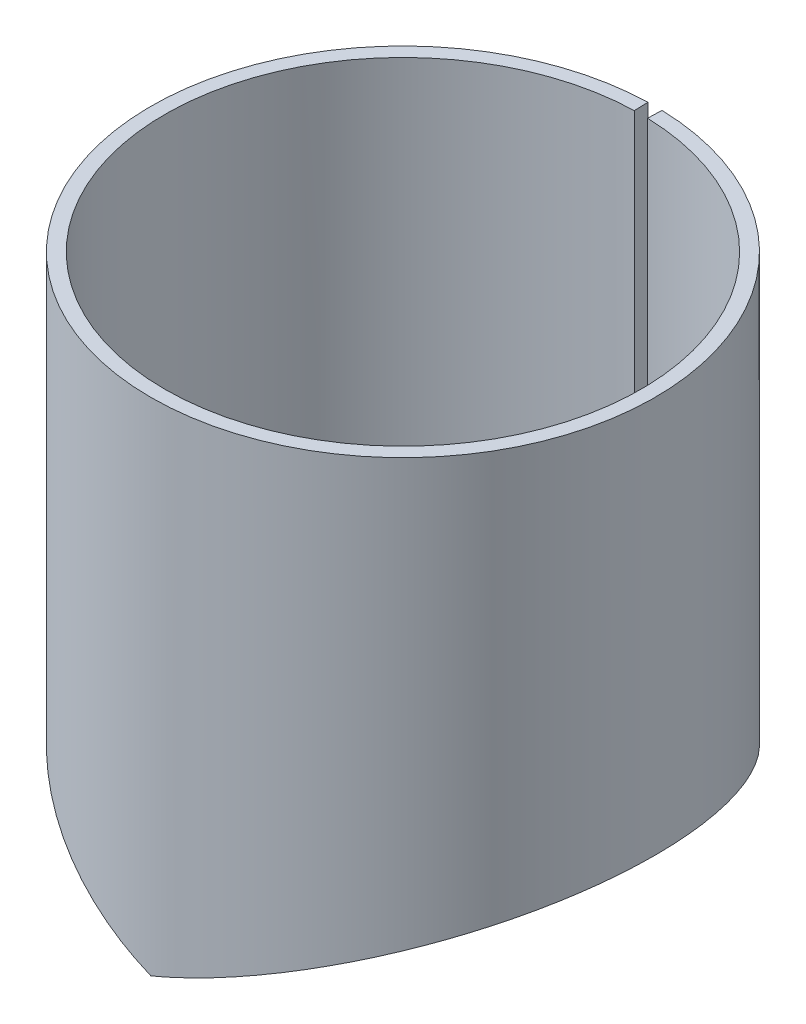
ISO-10303-21;
HEADER;
FILE_DESCRIPTION(('STEP AP214'),'2;1');
FILE_NAME('part.step','',(''),(''),'','','');
FILE_SCHEMA(('AUTOMOTIVE_DESIGN { 1 0 10303 214 1 1 1 1 }'));
ENDSEC;
DATA;
#1=APPLICATION_CONTEXT('core data for automotive mechanical design processes');
#2=APPLICATION_PROTOCOL_DEFINITION('international standard','automotive_design',2000,#1);
#3=PRODUCT_CONTEXT('',#1,'mechanical');
#4=PRODUCT('Part','Part','',(#3));
#5=PRODUCT_RELATED_PRODUCT_CATEGORY('part','',(#4));
#6=PRODUCT_DEFINITION_FORMATION('','',#4);
#7=PRODUCT_DEFINITION_CONTEXT('part definition',#1,'design');
#8=PRODUCT_DEFINITION('design','',#6,#7);
#9=PRODUCT_DEFINITION_SHAPE('','',#8);
#10=(LENGTH_UNIT() NAMED_UNIT(*) SI_UNIT(.MILLI.,.METRE.));
#11=(NAMED_UNIT(*) PLANE_ANGLE_UNIT() SI_UNIT($,.RADIAN.));
#12=(NAMED_UNIT(*) SI_UNIT($,.STERADIAN.) SOLID_ANGLE_UNIT());
#13=UNCERTAINTY_MEASURE_WITH_UNIT(LENGTH_MEASURE(1.E-05),#10,'distance_accuracy_value','');
#14=(GEOMETRIC_REPRESENTATION_CONTEXT(3) GLOBAL_UNCERTAINTY_ASSIGNED_CONTEXT((#13)) GLOBAL_UNIT_ASSIGNED_CONTEXT((#10,
#11,#12)) REPRESENTATION_CONTEXT('',''));
#15=CARTESIAN_POINT('',(0.,0.,0.));
#16=DIRECTION('',(0.,0.,1.));
#17=DIRECTION('',(1.,0.,0.));
#18=AXIS2_PLACEMENT_3D('',#15,#16,#17);
#19=CARTESIAN_POINT('',(0.,50.,0.));
#20=DIRECTION('',(0.,-1.,0.));
#21=DIRECTION('',(0.,0.,-1.));
#22=AXIS2_PLACEMENT_3D('',#19,#20,#21);
#23=PLANE('',#22);
#24=DIRECTION('',(0.0278349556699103,0.,-0.999612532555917));
#25=VECTOR('',#24,1.);
#26=CARTESIAN_POINT('',(0.472165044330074,50.,-16.9564522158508));
#27=LINE('',#26,#25);
#28=CARTESIAN_POINT('',(0.472165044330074,50.,-16.9564522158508));
#29=VERTEX_POINT('',#28);
#30=CARTESIAN_POINT('',(0.499999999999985,50.,-17.9560647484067));
#31=VERTEX_POINT('',#30);
#32=EDGE_CURVE('E13',#29,#31,#27,.T.);
#33=ORIENTED_EDGE('',*,*,#32,.F.);
#34=CARTESIAN_POINT('',(0.,50.,0.));
#35=DIRECTION('',(0.,1.,0.));
#36=DIRECTION('',(0.,0.,1.));
#37=AXIS2_PLACEMENT_3D('',#34,#35,#36);
#38=CIRCLE('',#37,16.9630248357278);
#39=CARTESIAN_POINT('',(-0.47216504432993,50.,-16.9564522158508));
#40=VERTEX_POINT('',#39);
#41=EDGE_CURVE('E85',#40,#29,#38,.T.);
#42=ORIENTED_EDGE('',*,*,#41,.F.);
#43=DIRECTION('',(-0.0278349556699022,0.,-0.999612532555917));
#44=VECTOR('',#43,1.);
#45=CARTESIAN_POINT('',(-0.47216504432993,50.,-16.9564522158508));
#46=LINE('',#45,#44);
#47=CARTESIAN_POINT('',(-0.49999999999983,50.,-17.9560647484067));
#48=VERTEX_POINT('',#47);
#49=EDGE_CURVE('E50',#40,#48,#46,.T.);
#50=ORIENTED_EDGE('',*,*,#49,.T.);
#51=CARTESIAN_POINT('',(0.,50.,0.));
#52=DIRECTION('',(0.,1.,0.));
#53=DIRECTION('',(0.,0.,1.));
#54=AXIS2_PLACEMENT_3D('',#51,#52,#53);
#55=CIRCLE('',#54,17.9630248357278);
#56=EDGE_CURVE('E87',#48,#31,#55,.T.);
#57=ORIENTED_EDGE('',*,*,#56,.T.);
#58=EDGE_LOOP('',(#33,#42,#50,#57));
#59=FACE_BOUND('',#58,.T.);
#60=ADVANCED_FACE('F38',(#59),#23,.F.);
#61=CARTESIAN_POINT('',(-0.47216504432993,32.2566347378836,-16.9564522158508));
#62=DIRECTION('',(-0.999612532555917,0.,0.0278349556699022));
#63=DIRECTION('',(0.,1.,0.));
#64=AXIS2_PLACEMENT_3D('',#61,#62,#63);
#65=PLANE('',#64);
#66=ORIENTED_EDGE('',*,*,#49,.F.);
#67=DIRECTION('',(0.,1.,0.));
#68=VECTOR('',#67,1.);
#69=CARTESIAN_POINT('',(-0.47216504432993,14.5132694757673,-16.9564522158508));
#70=LINE('',#69,#68);
#71=CARTESIAN_POINT('',(-0.472165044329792,14.5132694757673,-16.9564522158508));
#72=VERTEX_POINT('',#71);
#73=EDGE_CURVE('E95',#72,#40,#70,.T.);
#74=ORIENTED_EDGE('',*,*,#73,.F.);
#75=CARTESIAN_POINT('',(-0.499999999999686,14.5132694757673,-17.9560647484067));
#76=CARTESIAN_POINT('',(-0.472165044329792,14.5132694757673,-16.9564522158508));
#77=B_SPLINE_CURVE_WITH_KNOTS('',1,(#75,#76),.UNSPECIFIED.,.F.,.F.,(2,2),(0.,1.),.UNSPECIFIED.);
#78=CARTESIAN_POINT('',(-0.49999999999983,14.5132694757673,-17.9560647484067));
#79=VERTEX_POINT('',#78);
#80=EDGE_CURVE('E225',#72,#79,#77,.F.);
#81=ORIENTED_EDGE('',*,*,#80,.T.);
#82=DIRECTION('',(0.,1.,0.));
#83=VECTOR('',#82,1.);
#84=CARTESIAN_POINT('',(-0.49999999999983,-97.0486523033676,-17.9560647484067));
#85=LINE('',#84,#83);
#86=EDGE_CURVE('E156',#79,#48,#85,.T.);
#87=ORIENTED_EDGE('',*,*,#86,.T.);
#88=EDGE_LOOP('',(#66,#74,#81,#87));
#89=FACE_BOUND('',#88,.T.);
#90=ADVANCED_FACE('F191',(#89),#65,.F.);
#91=CARTESIAN_POINT('',(0.,14.3061626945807,17.9630248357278));
#92=CARTESIAN_POINT('',(-0.745303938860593,14.6148724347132,17.9630248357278));
#93=CARTESIAN_POINT('',(-1.3964790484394,14.8841543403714,17.9173714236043));
#94=CARTESIAN_POINT('',(-2.22949443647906,15.2292447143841,17.8263187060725));
#95=CARTESIAN_POINT('',(-2.4832691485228,15.3344522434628,17.7920708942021));
#96=CARTESIAN_POINT('',(-2.82832005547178,15.4775296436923,17.7393462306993));
#97=CARTESIAN_POINT('',(-2.93740486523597,15.5227664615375,17.721537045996));
#98=CARTESIAN_POINT('',(-3.0921834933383,15.5869382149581,17.6949541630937));
#99=CARTESIAN_POINT('',(-3.14230170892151,15.6077148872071,17.6861144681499));
#100=CARTESIAN_POINT('',(-3.21527399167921,15.6379590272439,17.6729421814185));
#101=CARTESIAN_POINT('',(-3.23923058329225,15.6478869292,17.668565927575));
#102=CARTESIAN_POINT('',(-3.27461511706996,15.66254856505,17.662029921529));
#103=CARTESIAN_POINT('',(-3.28631823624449,15.667397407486,17.6598559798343));
#104=CARTESIAN_POINT('',(-3.30373544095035,15.6746131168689,17.65660296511));
#105=CARTESIAN_POINT('',(-3.30951826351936,15.6770087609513,17.6555199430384));
#106=CARTESIAN_POINT('',(-3.31815814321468,15.6805878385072,17.6538974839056));
#107=CARTESIAN_POINT('',(-3.32103237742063,15.6817784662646,17.6533570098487));
#108=CARTESIAN_POINT('',(-3.3253351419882,15.6835608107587,17.6525468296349));
#109=CARTESIAN_POINT('',(-3.32676796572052,15.6841543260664,17.6522768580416));
#110=CARTESIAN_POINT('',(-3.32963075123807,15.6853401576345,17.65173709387));
#111=CARTESIAN_POINT('',(-3.33011179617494,15.6855394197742,17.6516464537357));
#112=CARTESIAN_POINT('',(-3.94111588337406,15.9386255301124,17.5362908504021));
#113=CARTESIAN_POINT('',(-4.5153510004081,16.1763037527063,17.3953274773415));
#114=CARTESIAN_POINT('',(-5.32391662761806,16.5111864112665,17.1582359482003));
#115=CARTESIAN_POINT('',(-5.58466484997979,16.6192081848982,17.0749167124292));
#116=CARTESIAN_POINT('',(-5.96266746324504,16.7758321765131,16.9450467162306));
#117=CARTESIAN_POINT('',(-6.0864828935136,16.8271387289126,16.9009405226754));
#118=CARTESIAN_POINT('',(-6.26894278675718,16.9027463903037,16.8337404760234));
#119=CARTESIAN_POINT('',(-6.32921893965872,16.9277235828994,16.8111669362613));
#120=CARTESIAN_POINT('',(-6.41881986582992,16.9648513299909,16.7770686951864));
#121=CARTESIAN_POINT('',(-6.44855129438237,16.9771709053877,16.7656629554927));
#122=CARTESIAN_POINT('',(-6.49294545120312,16.9955657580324,16.7484976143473));
#123=CARTESIAN_POINT('',(-6.50770967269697,17.0016832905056,16.7427663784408));
#124=CARTESIAN_POINT('',(-6.52980530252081,17.0108384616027,16.7341556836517));
#125=CARTESIAN_POINT('',(-6.53716206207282,17.0138866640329,16.7312831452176));
#126=CARTESIAN_POINT('',(-6.54818453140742,17.0184536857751,16.7269709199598));
#127=CARTESIAN_POINT('',(-6.55185657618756,17.0199751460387,16.7255329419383));
#128=CARTESIAN_POINT('',(-6.55919644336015,17.0230163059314,16.7226558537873));
#129=CARTESIAN_POINT('',(-6.56215870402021,17.0242436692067,16.7214938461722));
#130=CARTESIAN_POINT('',(-7.12605297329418,17.2578827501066,16.500029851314));
#131=CARTESIAN_POINT('',(-7.65890087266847,17.4785128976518,16.2583439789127));
#132=CARTESIAN_POINT('',(-8.4173688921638,17.7926614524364,15.8713176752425));
#133=CARTESIAN_POINT('',(-8.66340474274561,17.8945781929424,15.7382198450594));
#134=CARTESIAN_POINT('',(-9.02229339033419,18.0432541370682,15.5334302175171));
#135=CARTESIAN_POINT('',(-9.1402294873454,18.0921129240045,15.4643094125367));
#136=CARTESIAN_POINT('',(-9.31460164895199,18.1643513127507,15.3594614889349));
#137=CARTESIAN_POINT('',(-9.37230374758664,18.1882558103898,15.3243176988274));
#138=CARTESIAN_POINT('',(-9.45822535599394,18.2238501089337,15.2713249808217));
#139=CARTESIAN_POINT('',(-9.48676063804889,18.2356711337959,15.2536145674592));
#140=CARTESIAN_POINT('',(-9.52940587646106,18.2533370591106,15.2269815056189));
#141=CARTESIAN_POINT('',(-9.54359467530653,18.2592147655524,15.2180925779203));
#142=CARTESIAN_POINT('',(-9.5648384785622,18.2680149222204,15.2047425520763));
#143=CARTESIAN_POINT('',(-9.57191318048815,18.270945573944,15.2002897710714));
#144=CARTESIAN_POINT('',(-9.586049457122,18.2768014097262,15.1913787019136));
#145=CARTESIAN_POINT('',(-9.59225361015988,18.2793714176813,15.1874625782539));
#146=CARTESIAN_POINT('',(-10.106561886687,18.4924171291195,14.8622553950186));
#147=CARTESIAN_POINT('',(-10.5870781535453,18.6913837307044,14.5229383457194));
#148=CARTESIAN_POINT('',(-11.2685093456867,18.9736314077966,13.9919220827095));
#149=CARTESIAN_POINT('',(-11.4891058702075,19.0650135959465,13.8112390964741));
#150=CARTESIAN_POINT('',(-11.8101983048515,19.19803632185,13.5354860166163));
#151=CARTESIAN_POINT('',(-11.9155959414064,19.2417021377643,13.4427799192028));
#152=CARTESIAN_POINT('',(-12.0712497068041,19.3061882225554,13.3026338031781));
#153=CARTESIAN_POINT('',(-12.122727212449,19.3275148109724,13.255737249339));
#154=CARTESIAN_POINT('',(-12.1993340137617,19.3592515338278,13.1851324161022));
#155=CARTESIAN_POINT('',(-12.2247680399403,19.3697882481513,13.1615541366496));
#156=CARTESIAN_POINT('',(-12.2627668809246,19.3855300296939,13.1261231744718));
#157=CARTESIAN_POINT('',(-12.2754077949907,19.3907667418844,13.1143022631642));
#158=CARTESIAN_POINT('',(-12.2943311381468,19.3986059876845,13.0965551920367));
#159=CARTESIAN_POINT('',(-12.3006325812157,19.4012164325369,13.0906368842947));
#160=CARTESIAN_POINT('',(-12.3132227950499,19.4064320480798,13.078795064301));
#161=CARTESIAN_POINT('',(-12.3187698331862,19.4087299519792,13.0735712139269));
#162=CARTESIAN_POINT('',(-13.2248876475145,19.7840942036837,12.2188480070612));
#163=CARTESIAN_POINT('',(-14.0158362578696,20.1109995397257,11.2969699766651));
#164=CARTESIAN_POINT('',(-15.0347121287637,20.533033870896,9.84766095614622));
#165=CARTESIAN_POINT('',(-15.3465338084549,20.6623247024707,9.35344174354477));
#166=CARTESIAN_POINT('',(-15.7728809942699,20.8391800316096,8.60056185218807));
#167=CARTESIAN_POINT('',(-15.9081054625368,20.8952849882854,8.34767345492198));
#168=CARTESIAN_POINT('',(-16.1006986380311,20.9751721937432,7.96605719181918));
#169=CARTESIAN_POINT('',(-16.1631894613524,21.0010895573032,7.83847093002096));
#170=CARTESIAN_POINT('',(-16.2543800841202,21.0388980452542,7.64659427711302));
#171=CARTESIAN_POINT('',(-16.2843527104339,21.0513229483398,7.58255250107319));
#172=CARTESIAN_POINT('',(-16.3286773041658,21.0696934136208,7.48637461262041));
#173=CARTESIAN_POINT('',(-16.3433464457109,21.07577242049,7.45429611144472));
#174=CARTESIAN_POINT('',(-16.3651918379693,21.0848242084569,7.40615068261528));
#175=CARTESIAN_POINT('',(-16.3724472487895,21.087830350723,7.39009759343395));
#176=CARTESIAN_POINT('',(-16.3832908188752,21.0923228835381,7.36601118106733));
#177=CARTESIAN_POINT('',(-16.3868987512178,21.093817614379,7.35798124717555));
#178=CARTESIAN_POINT('',(-16.3941014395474,21.0968015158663,7.34191914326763));
#179=CARTESIAN_POINT('',(-16.397364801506,21.0981534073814,7.33462890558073));
#180=CARTESIAN_POINT('',(-16.902988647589,21.3076067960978,6.20262698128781));
#181=CARTESIAN_POINT('',(-17.2851625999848,21.4653595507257,5.03613741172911));
#182=CARTESIAN_POINT('',(-17.6750788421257,21.6268732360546,3.26024008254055));
#183=CARTESIAN_POINT('',(-17.7745809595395,21.6681918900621,2.66390694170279));
#184=CARTESIAN_POINT('',(-17.8783790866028,21.7113910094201,1.76756592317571));
#185=CARTESIAN_POINT('',(-17.9054076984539,21.7226609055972,1.46847740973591));
#186=CARTESIAN_POINT('',(-17.9444243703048,21.7389410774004,0.870450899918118));
#187=CARTESIAN_POINT('',(-17.9563978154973,21.7439452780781,0.572477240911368));
#188=CARTESIAN_POINT('',(-17.9791577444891,21.7533779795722,-0.924776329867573));
#189=CARTESIAN_POINT('',(-17.8772505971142,21.7106335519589,-2.13228832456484));
#190=CARTESIAN_POINT('',(-17.5403517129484,21.5710810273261,-3.92102580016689));
#191=CARTESIAN_POINT('',(-17.3974565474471,21.5119908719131,-4.51349195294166));
#192=CARTESIAN_POINT('',(-17.1374656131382,21.4044966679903,-5.39172924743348));
#193=CARTESIAN_POINT('',(-17.0431991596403,21.3655221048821,-5.68273063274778));
#194=CARTESIAN_POINT('',(-16.8904736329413,21.3023455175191,-6.11601280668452));
#195=CARTESIAN_POINT('',(-16.8376778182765,21.2805008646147,-6.2599035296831));
#196=CARTESIAN_POINT('',(-16.7556659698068,21.2465551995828,-6.47485910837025));
#197=CARTESIAN_POINT('',(-16.7278590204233,21.2350435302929,-6.54636421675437));
#198=CARTESIAN_POINT('',(-16.685445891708,21.2174813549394,-6.65339231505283));
#199=CARTESIAN_POINT('',(-16.6711910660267,21.2115781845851,-6.68903008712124));
#200=CARTESIAN_POINT('',(-16.6496333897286,21.2026497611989,-6.74242817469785));
#201=CARTESIAN_POINT('',(-16.6424182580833,21.1996613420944,-6.7602177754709));
#202=CARTESIAN_POINT('',(-16.6315517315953,21.1951602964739,-6.78688738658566));
#203=CARTESIAN_POINT('',(-16.6279222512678,21.1936568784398,-6.79577479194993));
#204=CARTESIAN_POINT('',(-16.6206486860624,21.1906439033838,-6.81354464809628));
#205=CARTESIAN_POINT('',(-16.6167172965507,21.1890153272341,-6.82312580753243));
#206=CARTESIAN_POINT('',(-16.1827509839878,21.0092399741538,-7.87850738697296));
#207=CARTESIAN_POINT('',(-15.6428392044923,20.7849499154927,-8.90918408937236));
#208=CARTESIAN_POINT('',(-14.6643526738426,20.3796523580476,-10.391219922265));
#209=CARTESIAN_POINT('',(-14.3101759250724,20.2330760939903,-10.8745121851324));
#210=CARTESIAN_POINT('',(-13.7372021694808,19.995996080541,-11.5780399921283));
#211=CARTESIAN_POINT('',(-13.5392662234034,19.9141001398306,-11.8089782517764));
#212=CARTESIAN_POINT('',(-13.2320480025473,19.7869523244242,-12.1493426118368));
#213=CARTESIAN_POINT('',(-13.127923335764,19.7438524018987,-12.2617901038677));
#214=CARTESIAN_POINT('',(-12.9691754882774,19.6781265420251,-12.4288635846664));
#215=CARTESIAN_POINT('',(-12.9158327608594,19.6560385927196,-12.4842884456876));
#216=CARTESIAN_POINT('',(-12.8351809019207,19.6226376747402,-12.5670153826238));
#217=CARTESIAN_POINT('',(-12.8081906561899,19.6114592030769,-12.594522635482));
#218=CARTESIAN_POINT('',(-12.7675461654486,19.5946242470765,-12.6356795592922));
#219=CARTESIAN_POINT('',(-12.7539714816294,19.5890013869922,-12.649381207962));
#220=CARTESIAN_POINT('',(-12.7335697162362,19.5805502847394,-12.6699075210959));
#221=CARTESIAN_POINT('',(-12.7267625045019,19.577730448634,-12.6767452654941));
#222=CARTESIAN_POINT('',(-12.7131348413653,19.5720851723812,-12.690412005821));
#223=CARTESIAN_POINT('',(-12.7056237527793,19.5689736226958,-12.6979313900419));
#224=CARTESIAN_POINT('',(-12.3067557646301,19.4037350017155,-13.0966556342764));
#225=CARTESIAN_POINT('',(-11.8879914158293,19.2302213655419,-13.4788435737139));
#226=CARTESIAN_POINT('',(-11.2204551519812,18.9537251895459,-14.0305015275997));
#227=CARTESIAN_POINT('',(-10.9913860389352,18.8588555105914,-14.2107785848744));
#228=CARTESIAN_POINT('',(-10.6379812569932,18.7124945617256,-14.4749870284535));
#229=CARTESIAN_POINT('',(-10.5185467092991,18.6630315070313,-14.5620217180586));
#230=CARTESIAN_POINT('',(-10.3369550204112,18.5878228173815,-14.6909200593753));
#231=CARTESIAN_POINT('',(-10.2760178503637,18.5625842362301,-14.7336105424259));
#232=CARTESIAN_POINT('',(-10.1840037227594,18.524472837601,-14.7972200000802));
#233=CARTESIAN_POINT('',(-10.1532309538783,18.5117267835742,-14.8183521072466));
#234=CARTESIAN_POINT('',(-10.1069199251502,18.4925443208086,-14.8499420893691));
#235=CARTESIAN_POINT('',(-10.0914576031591,18.4861396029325,-14.8604540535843));
#236=CARTESIAN_POINT('',(-10.0682261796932,18.4765166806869,-14.8761947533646));
#237=CARTESIAN_POINT('',(-10.0604760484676,18.4733063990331,-14.8814371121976));
#238=CARTESIAN_POINT('',(-10.0449631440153,18.4668805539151,-14.8919127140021));
#239=CARTESIAN_POINT('',(-10.0364033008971,18.4633348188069,-14.8976823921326));
#240=CARTESIAN_POINT('',(-9.58322187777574,18.2756126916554,-15.2026775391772));
#241=CARTESIAN_POINT('',(-9.1106432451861,18.0798270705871,-15.4916089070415));
#242=CARTESIAN_POINT('',(-8.36191045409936,17.7697213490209,-15.9006160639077));
#243=CARTESIAN_POINT('',(-8.10569889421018,17.663614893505,-16.0328799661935));
#244=CARTESIAN_POINT('',(-7.71149233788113,17.5003483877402,-16.2241942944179));
#245=CARTESIAN_POINT('',(-7.5784426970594,17.4452417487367,-16.2867851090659));
#246=CARTESIAN_POINT('',(-7.37641177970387,17.3615550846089,-16.3787754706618));
#247=CARTESIAN_POINT('',(-7.30865878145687,17.3334884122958,-16.4091229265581));
#248=CARTESIAN_POINT('',(-7.20641754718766,17.2911317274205,-16.4541543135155));
#249=CARTESIAN_POINT('',(-7.17223518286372,17.2769700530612,-16.4690831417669));
#250=CARTESIAN_POINT('',(-7.12080902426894,17.2556633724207,-16.4913519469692));
#251=CARTESIAN_POINT('',(-7.10364153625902,17.2485504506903,-16.4987541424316));
#252=CARTESIAN_POINT('',(-7.07785219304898,17.2378650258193,-16.509826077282));
#253=CARTESIAN_POINT('',(-7.06924939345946,17.2343005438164,-16.5135114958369));
#254=CARTESIAN_POINT('',(-7.05633567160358,17.2289498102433,-16.5190317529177));
#255=CARTESIAN_POINT('',(-7.05202951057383,17.2271655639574,-16.520870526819));
#256=CARTESIAN_POINT('',(-7.0434140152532,17.2235957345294,-16.5245454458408));
#257=CARTESIAN_POINT('',(-7.03846940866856,17.2215469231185,-16.5266519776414));
#258=CARTESIAN_POINT('',(-6.56431079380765,17.0250769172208,-16.7284649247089));
#259=CARTESIAN_POINT('',(-6.06167607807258,16.8167808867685,-16.918708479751));
#260=CARTESIAN_POINT('',(-5.25891954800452,16.484313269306,-17.1782744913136));
#261=CARTESIAN_POINT('',(-4.98321494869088,16.3701534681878,-17.2604829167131));
#262=CARTESIAN_POINT('',(-4.5575632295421,16.1939078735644,-17.3758593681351));
#263=CARTESIAN_POINT('',(-4.41366471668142,16.1343250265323,-17.4129947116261));
#264=CARTESIAN_POINT('',(-4.19481697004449,16.0436992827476,-17.4665226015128));
#265=CARTESIAN_POINT('',(-4.12136780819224,16.0132821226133,-17.484002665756));
#266=CARTESIAN_POINT('',(-4.01044770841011,15.9673435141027,-17.5096547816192));
#267=CARTESIAN_POINT('',(-3.97334995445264,15.9519784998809,-17.518110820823));
#268=CARTESIAN_POINT('',(-3.91751723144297,15.9288527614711,-17.530649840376));
#269=CARTESIAN_POINT('',(-3.8988753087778,15.9211311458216,-17.5348053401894));
#270=CARTESIAN_POINT('',(-3.87086596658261,15.909529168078,-17.5410019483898));
#271=CARTESIAN_POINT('',(-3.86152177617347,15.9056585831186,-17.5430613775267));
#272=CARTESIAN_POINT('',(-3.84749388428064,15.8998478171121,-17.5461413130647));
#273=CARTESIAN_POINT('',(-3.8428159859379,15.8979100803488,-17.5471664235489));
#274=CARTESIAN_POINT('',(-3.83579623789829,15.8950022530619,-17.5487017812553));
#275=CARTESIAN_POINT('',(-3.83345583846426,15.8940327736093,-17.5492131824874));
#276=CARTESIAN_POINT('',(-3.82877407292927,15.8920934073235,-17.5502352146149));
#277=CARTESIAN_POINT('',(-3.82567363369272,15.8908090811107,-17.5509112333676));
#278=CARTESIAN_POINT('',(-3.41890014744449,15.7223067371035,-17.6395395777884));
#279=CARTESIAN_POINT('',(-2.94005031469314,15.5236430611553,-17.7296011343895));
#280=CARTESIAN_POINT('',(-1.83211716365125,15.0646817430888,-17.8780871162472));
#281=CARTESIAN_POINT('',(-1.20299166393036,14.8044346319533,-17.9364894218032));
#282=CARTESIAN_POINT('',(-0.499999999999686,14.5132694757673,-17.9560647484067));
#283=CARTESIAN_POINT('',(0.,14.3061626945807,16.9630248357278));
#284=CARTESIAN_POINT('',(-0.703810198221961,14.6148712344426,16.9630248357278));
#285=CARTESIAN_POINT('',(-1.31873718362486,14.8841543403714,16.9199129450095));
#286=CARTESIAN_POINT('',(-2.10537867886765,15.2292447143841,16.83392912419));
#287=CARTESIAN_POINT('',(-2.34502577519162,15.3344522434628,16.8015878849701));
#288=CARTESIAN_POINT('',(-2.67086772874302,15.4775296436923,16.7517983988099));
#289=CARTESIAN_POINT('',(-2.77387979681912,15.5227664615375,16.73498064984));
#290=CARTESIAN_POINT('',(-2.92004191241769,15.5869382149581,16.709877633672));
#291=CARTESIAN_POINT('',(-2.96737005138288,15.6077148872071,16.701530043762));
#292=CARTESIAN_POINT('',(-3.03627997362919,15.6379590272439,16.6890910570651));
#293=CARTESIAN_POINT('',(-3.05890290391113,15.6478869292,16.6849584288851));
#294=CARTESIAN_POINT('',(-3.09231758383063,15.66254856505,16.6787862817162));
#295=CARTESIAN_POINT('',(-3.10336919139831,15.667397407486,16.6767333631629));
#296=CARTESIAN_POINT('',(-3.11981678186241,15.6746131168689,16.6736614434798));
#297=CARTESIAN_POINT('',(-3.12527767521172,15.6770087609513,16.672638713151));
#298=CARTESIAN_POINT('',(-3.13343657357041,15.6805878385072,16.6711065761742));
#299=CARTESIAN_POINT('',(-3.13615079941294,15.6817784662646,16.6705961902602));
#300=CARTESIAN_POINT('',(-3.14021402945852,15.6835608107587,16.669831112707));
#301=CARTESIAN_POINT('',(-3.1415670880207,15.6841543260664,16.6695761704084));
#302=CARTESIAN_POINT('',(-3.1442705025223,15.6853401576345,16.6690664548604));
#303=CARTESIAN_POINT('',(-3.14472476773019,15.6855394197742,16.6689808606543));
#304=CARTESIAN_POINT('',(-3.72171431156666,15.9386255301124,16.5600470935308));
#305=CARTESIAN_POINT('',(-4.2639818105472,16.1763037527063,16.4269311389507));
#306=CARTESIAN_POINT('',(-5.02753466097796,16.5111864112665,16.2030384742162));
#307=CARTESIAN_POINT('',(-5.27376705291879,16.6192081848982,16.1243576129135));
#308=CARTESIAN_POINT('',(-5.63072629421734,16.7758321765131,16.0017174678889));
#309=CARTESIAN_POINT('',(-5.74764893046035,16.8271387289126,15.9600666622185));
#310=CARTESIAN_POINT('',(-5.91995129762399,16.9027463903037,15.8966076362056));
#311=CARTESIAN_POINT('',(-5.97687188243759,16.9277235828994,15.8752907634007));
#312=CARTESIAN_POINT('',(-6.06148473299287,16.9648513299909,15.8430907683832));
#313=CARTESIAN_POINT('',(-6.0895610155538,16.9771709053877,15.8323199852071));
#314=CARTESIAN_POINT('',(-6.13148375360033,16.9955657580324,15.8161102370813));
#315=CARTESIAN_POINT('',(-6.14542605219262,17.0016832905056,15.8106980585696));
#316=CARTESIAN_POINT('',(-6.16629162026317,17.0108384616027,15.802566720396));
#317=CARTESIAN_POINT('',(-6.17323882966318,17.0138866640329,15.7998540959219));
#318=CARTESIAN_POINT('',(-6.18364767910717,17.0184536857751,15.7957819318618));
#319=CARTESIAN_POINT('',(-6.18711530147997,17.0199751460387,15.7944240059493));
#320=CARTESIAN_POINT('',(-6.19404655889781,17.0230163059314,15.7917070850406));
#321=CARTESIAN_POINT('',(-6.19684391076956,17.0242436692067,15.7906097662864));
#322=CARTESIAN_POINT('',(-6.72934623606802,17.2578827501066,15.5814746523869));
#323=CARTESIAN_POINT('',(-7.23253054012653,17.4785128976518,15.3532434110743));
#324=CARTESIAN_POINT('',(-7.94877471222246,17.7926614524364,14.9877628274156));
#325=CARTESIAN_POINT('',(-8.18111376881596,17.8945781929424,14.8620745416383));
#326=CARTESIAN_POINT('',(-8.52002311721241,18.0432541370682,14.6686855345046));
#327=CARTESIAN_POINT('',(-8.63139372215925,18.0921129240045,14.6034126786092));
#328=CARTESIAN_POINT('',(-8.79605860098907,18.1643513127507,14.5044016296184));
#329=CARTESIAN_POINT('',(-8.8505484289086,18.1882558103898,14.4712142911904));
#330=CARTESIAN_POINT('',(-8.93168678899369,18.2238501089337,14.4211716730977));
#331=CARTESIAN_POINT('',(-8.95863351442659,18.2356711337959,14.4044471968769));
#332=CARTESIAN_POINT('',(-8.99890469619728,18.2533370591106,14.379296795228));
#333=CARTESIAN_POINT('',(-9.01230360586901,18.2592147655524,14.3709027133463));
#334=CARTESIAN_POINT('',(-9.03236476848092,18.2680149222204,14.3582958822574));
#335=CARTESIAN_POINT('',(-9.03904562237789,18.270945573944,14.3540909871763));
#336=CARTESIAN_POINT('',(-9.05239493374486,18.2768014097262,14.3456759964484));
#337=CARTESIAN_POINT('',(-9.05825370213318,18.2793714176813,14.3419778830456));
#338=CARTESIAN_POINT('',(-9.54393048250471,18.4924171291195,14.0348749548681));
#339=CARTESIAN_POINT('',(-9.99769645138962,18.6913837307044,13.7144476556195));
#340=CARTESIAN_POINT('',(-10.6411924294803,18.9736314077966,13.2129930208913));
#341=CARTESIAN_POINT('',(-10.8495083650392,19.0650135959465,13.0423686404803));
#342=CARTESIAN_POINT('',(-11.1527256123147,19.19803632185,12.7819667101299));
#343=CARTESIAN_POINT('',(-11.2522557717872,19.2417021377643,12.69442155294));
#344=CARTESIAN_POINT('',(-11.3992443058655,19.3061882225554,12.5620773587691));
#345=CARTESIAN_POINT('',(-11.4478560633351,19.3275148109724,12.5177915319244));
#346=CARTESIAN_POINT('',(-11.5201981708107,19.3592515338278,12.4511172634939));
#347=CARTESIAN_POINT('',(-11.544216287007,19.3697882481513,12.4288515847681));
#348=CARTESIAN_POINT('',(-11.5800997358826,19.3855300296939,12.3953930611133));
#349=CARTESIAN_POINT('',(-11.5920369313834,19.3907667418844,12.3842302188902));
#350=CARTESIAN_POINT('',(-11.6099068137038,19.3986059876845,12.3674711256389));
#351=CARTESIAN_POINT('',(-11.6158574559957,19.4012164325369,12.3618822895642));
#352=CARTESIAN_POINT('',(-11.627746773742,19.4064320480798,12.3506997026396));
#353=CARTESIAN_POINT('',(-11.6329850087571,19.4087299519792,12.3457666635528));
#354=CARTESIAN_POINT('',(-12.4886593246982,19.7840942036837,11.5386258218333));
#355=CARTESIAN_POINT('',(-13.2355758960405,20.1109995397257,10.6680686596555));
#356=CARTESIAN_POINT('',(-14.1977310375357,20.533033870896,9.29944254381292));
#357=CARTESIAN_POINT('',(-14.4921936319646,20.6623247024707,8.83273647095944));
#358=CARTESIAN_POINT('',(-14.8948061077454,20.8391800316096,8.12176933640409));
#359=CARTESIAN_POINT('',(-15.0225026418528,20.8952849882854,7.88295921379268));
#360=CARTESIAN_POINT('',(-15.2043741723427,20.9751721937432,7.52258749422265));
#361=CARTESIAN_POINT('',(-15.2633861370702,21.0010895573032,7.40210394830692));
#362=CARTESIAN_POINT('',(-15.3495001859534,21.0388980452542,7.22090905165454));
#363=CARTESIAN_POINT('',(-15.3778042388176,21.0513229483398,7.16043247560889));
#364=CARTESIAN_POINT('',(-15.4196612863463,21.0696934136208,7.06960880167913));
#365=CARTESIAN_POINT('',(-15.4335137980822,21.07577242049,7.03931610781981));
#366=CARTESIAN_POINT('',(-15.4541430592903,21.0848242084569,6.99385093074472));
#367=CARTESIAN_POINT('',(-15.4609945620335,21.087830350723,6.97869151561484));
#368=CARTESIAN_POINT('',(-15.4712344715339,21.0923228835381,6.95594599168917));
#369=CARTESIAN_POINT('',(-15.4746415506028,21.093817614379,6.94836308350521));
#370=CARTESIAN_POINT('',(-15.4814432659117,21.0968015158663,6.93319515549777));
#371=CARTESIAN_POINT('',(-15.4845249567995,21.0981534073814,6.92631076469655));
#372=CARTESIAN_POINT('',(-15.9620007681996,21.3076067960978,5.85732728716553));
#373=CARTESIAN_POINT('',(-16.3228991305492,21.4653595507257,4.75577608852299));
#374=CARTESIAN_POINT('',(-16.6911087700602,21.6268732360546,3.07874280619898));
#375=CARTESIAN_POINT('',(-16.7850716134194,21.6681918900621,2.51560747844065));
#376=CARTESIAN_POINT('',(-16.8830913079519,21.7113910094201,1.66916568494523));
#377=CARTESIAN_POINT('',(-16.9086152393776,21.7226609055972,1.38672740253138));
#378=CARTESIAN_POINT('',(-16.9454598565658,21.7389410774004,0.821992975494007));
#379=CARTESIAN_POINT('',(-16.956766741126,21.7439452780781,0.540607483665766));
#380=CARTESIAN_POINT('',(-16.9782596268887,21.7533779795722,-0.873294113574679));
#381=CARTESIAN_POINT('',(-16.8820256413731,21.7106335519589,-2.01358402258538));
#382=CARTESIAN_POINT('',(-16.5638818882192,21.5710810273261,-3.70274264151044));
#383=CARTESIAN_POINT('',(-16.4289416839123,21.5119908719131,-4.26222625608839));
#384=CARTESIAN_POINT('',(-16.1834244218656,21.4044966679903,-5.09157215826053));
#385=CARTESIAN_POINT('',(-16.0944057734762,21.3655221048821,-5.36637352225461));
#386=CARTESIAN_POINT('',(-15.9501824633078,21.3023455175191,-5.77553491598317));
#387=CARTESIAN_POINT('',(-15.9003257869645,21.2805008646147,-5.91141525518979));
#388=CARTESIAN_POINT('',(-15.8228795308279,21.2465551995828,-6.11440427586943));
#389=CARTESIAN_POINT('',(-15.7966205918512,21.2350435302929,-6.18192870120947));
#390=CARTESIAN_POINT('',(-15.7565685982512,21.2174813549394,-6.28299855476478));
#391=CARTESIAN_POINT('',(-15.7431073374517,21.2115781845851,-6.3166523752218));
#392=CARTESIAN_POINT('',(-15.7227497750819,21.2026497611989,-6.3670777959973));
#393=CARTESIAN_POINT('',(-15.7159363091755,21.1996613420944,-6.38387705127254));
#394=CARTESIAN_POINT('',(-15.7056747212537,21.1951602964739,-6.40906196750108));
#395=CARTESIAN_POINT('',(-15.7022472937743,21.1936568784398,-6.41745461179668));
#396=CARTESIAN_POINT('',(-15.695378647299,21.1906439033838,-6.43423522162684));
#397=CARTESIAN_POINT('',(-15.6916661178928,21.1890153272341,-6.44328299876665));
#398=CARTESIAN_POINT('',(-15.2818586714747,21.0092399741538,-7.43991157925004));
#399=CARTESIAN_POINT('',(-14.7720037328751,20.7849499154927,-8.41321060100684));
#400=CARTESIAN_POINT('',(-13.8479894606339,20.3796523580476,-9.81274163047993));
#401=CARTESIAN_POINT('',(-13.5135297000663,20.2330760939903,-10.2691290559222));
#402=CARTESIAN_POINT('',(-12.9724533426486,19.995996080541,-10.9334915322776));
#403=CARTESIAN_POINT('',(-12.7855364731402,19.9141001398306,-11.1515734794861));
#404=CARTESIAN_POINT('',(-12.4954210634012,19.7869523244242,-11.4729897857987));
#405=CARTESIAN_POINT('',(-12.397093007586,19.7438524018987,-11.5791773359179));
#406=CARTESIAN_POINT('',(-12.2471826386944,19.6781265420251,-11.7369498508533));
#407=CARTESIAN_POINT('',(-12.1968094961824,19.6560385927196,-11.7892892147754));
#408=CARTESIAN_POINT('',(-12.1206475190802,19.6226376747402,-11.867410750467));
#409=CARTESIAN_POINT('',(-12.0951598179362,19.6114592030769,-11.8933866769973));
#410=CARTESIAN_POINT('',(-12.0567780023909,19.5946242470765,-11.932252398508));
#411=CARTESIAN_POINT('',(-12.0439590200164,19.5890013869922,-11.9451912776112));
#412=CARTESIAN_POINT('',(-12.0246930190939,19.5805502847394,-11.9645748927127));
#413=CARTESIAN_POINT('',(-12.0182647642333,19.577730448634,-11.9710319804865));
#414=CARTESIAN_POINT('',(-12.0053957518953,19.5720851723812,-11.9839378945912));
#415=CARTESIAN_POINT('',(-11.9983028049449,19.5689736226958,-11.9910386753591));
#416=CARTESIAN_POINT('',(-11.6216397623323,19.4037350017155,-12.3675659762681));
#417=CARTESIAN_POINT('',(-11.2261879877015,19.2302213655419,-12.7284775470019));
#418=CARTESIAN_POINT('',(-10.595813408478,18.9537251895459,-13.249424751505));
#419=CARTESIAN_POINT('',(-10.3794965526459,18.8588555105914,-13.4196658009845));
#420=CARTESIAN_POINT('',(-10.0457657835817,18.7124945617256,-13.6691657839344));
#421=CARTESIAN_POINT('',(-9.93298014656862,18.6630315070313,-13.7513552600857));
#422=CARTESIAN_POINT('',(-9.76149765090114,18.5878228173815,-13.8730778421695));
#423=CARTESIAN_POINT('',(-9.70395284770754,18.5625842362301,-13.9133917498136));
#424=CARTESIAN_POINT('',(-9.61706113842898,18.524472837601,-13.9734600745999));
#425=CARTESIAN_POINT('',(-9.58800148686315,18.5117267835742,-13.9934157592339));
#426=CARTESIAN_POINT('',(-9.54426858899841,18.4925443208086,-14.0232471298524));
#427=CARTESIAN_POINT('',(-9.52966705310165,18.4861396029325,-14.0331738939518));
#428=CARTESIAN_POINT('',(-9.50772892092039,18.4765166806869,-14.0480383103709));
#429=CARTESIAN_POINT('',(-9.50041023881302,18.4733063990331,-14.0529888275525));
#430=CARTESIAN_POINT('',(-9.4857609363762,18.4668805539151,-14.0628812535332));
#431=CARTESIAN_POINT('',(-9.47767761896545,18.4633348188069,-14.0683297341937));
#432=CARTESIAN_POINT('',(-9.04972476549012,18.2756126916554,-14.3563458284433));
#433=CARTESIAN_POINT('',(-8.60345454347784,18.0798270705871,-14.6291924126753));
#434=CARTESIAN_POINT('',(-7.89640364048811,17.7697213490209,-15.0154301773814));
#435=CARTESIAN_POINT('',(-7.6544553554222,17.663614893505,-15.1403309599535));
#436=CARTESIAN_POINT('',(-7.28219424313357,17.5003483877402,-15.3209948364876));
#437=CARTESIAN_POINT('',(-7.15655146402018,17.4452417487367,-15.3801012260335));
#438=CARTESIAN_POINT('',(-6.96576758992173,17.3615550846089,-15.4669704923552));
#439=CARTESIAN_POINT('',(-6.90178639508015,17.3334884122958,-15.4956285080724));
#440=CARTESIAN_POINT('',(-6.80523692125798,17.2911317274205,-15.5381530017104));
#441=CARTESIAN_POINT('',(-6.77295748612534,17.2769700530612,-15.5522507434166));
#442=CARTESIAN_POINT('',(-6.72439421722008,17.2556633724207,-15.5732798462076));
#443=CARTESIAN_POINT('',(-6.7081824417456,17.2485504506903,-15.5802699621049));
#444=CARTESIAN_POINT('',(-6.68382878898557,17.2378650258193,-15.5907255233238));
#445=CARTESIAN_POINT('',(-6.67570490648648,17.2343005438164,-15.5942057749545));
#446=CARTESIAN_POINT('',(-6.66351009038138,17.2289498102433,-15.599418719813));
#447=CARTESIAN_POINT('',(-6.65944365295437,17.2271655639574,-15.6011551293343));
#448=CARTESIAN_POINT('',(-6.65130778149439,17.2235957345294,-15.6046254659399));
#449=CARTESIAN_POINT('',(-6.64663844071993,17.2215469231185,-15.606614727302));
#450=CARTESIAN_POINT('',(-6.19887619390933,17.0250769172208,-15.797192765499));
#451=CARTESIAN_POINT('',(-5.72422310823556,16.8167808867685,-15.9768454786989));
#452=CARTESIAN_POINT('',(-4.96615596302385,16.484313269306,-16.221961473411));
#453=CARTESIAN_POINT('',(-4.70579981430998,16.3701534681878,-16.2995933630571));
#454=CARTESIAN_POINT('',(-4.30384408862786,16.1939078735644,-16.4085468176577));
#455=CARTESIAN_POINT('',(-4.16795639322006,16.1343250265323,-16.4436148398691));
#456=CARTESIAN_POINT('',(-3.96129188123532,16.0436992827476,-16.4941628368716));
#457=CARTESIAN_POINT('',(-3.89193162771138,16.0132821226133,-16.5106697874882));
#458=CARTESIAN_POINT('',(-3.78718644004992,15.9673435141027,-16.5348938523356));
#459=CARTESIAN_POINT('',(-3.75215391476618,15.9519784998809,-16.5428791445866));
#460=CARTESIAN_POINT('',(-3.69942939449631,15.9288527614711,-16.5547201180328));
#461=CARTESIAN_POINT('',(-3.68182526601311,15.9211311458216,-16.55864428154));
#462=CARTESIAN_POINT('',(-3.65537520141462,15.909529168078,-16.5644959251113));
#463=CARTESIAN_POINT('',(-3.6465512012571,15.9056585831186,-16.5664407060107));
#464=CARTESIAN_POINT('',(-3.63330424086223,15.8998478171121,-16.5693491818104));
#465=CARTESIAN_POINT('',(-3.62888676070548,15.8979100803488,-16.5703172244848));
#466=CARTESIAN_POINT('',(-3.62225780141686,15.8950022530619,-16.5717671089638));
#467=CARTESIAN_POINT('',(-3.62004769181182,15.8940327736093,-16.5722500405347));
#468=CARTESIAN_POINT('',(-3.61562655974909,15.8920934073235,-16.5732151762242));
#469=CARTESIAN_POINT('',(-3.61269872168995,15.8908090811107,-16.573853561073));
#470=CARTESIAN_POINT('',(-3.22857027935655,15.7223067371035,-16.6575479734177));
#471=CARTESIAN_POINT('',(-2.77637797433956,15.5236430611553,-16.7425958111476));
#472=CARTESIAN_POINT('',(-1.73012336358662,15.0646817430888,-16.8828155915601));
#473=CARTESIAN_POINT('',(-1.1360192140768,14.8044337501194,-16.9379667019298));
#474=CARTESIAN_POINT('',(-0.472165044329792,14.5132694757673,-16.9564522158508));
#475=B_SPLINE_SURFACE_WITH_KNOTS('',1,3,((#91,#92,#93,#94,#95,#96,#97,#98,#99,#100,#101,#102,
#103,#104,#105,#106,#107,#108,#109,#110,#111,#112,#113,#114,#115,#116,#117,#118,#119,#120,#121,
#122,#123,#124,#125,#126,#127,#128,#129,#130,#131,#132,#133,#134,#135,#136,#137,#138,#139,#140,
#141,#142,#143,#144,#145,#146,#147,#148,#149,#150,#151,#152,#153,#154,#155,#156,#157,#158,#159,
#160,#161,#162,#163,#164,#165,#166,#167,#168,#169,#170,#171,#172,#173,#174,#175,#176,#177,#178,
#179,#180,#181,#182,#183,#184,#185,#186,#187,#188,#189,#190,#191,#192,#193,#194,#195,#196,#197,
#198,#199,#200,#201,#202,#203,#204,#205,#206,#207,#208,#209,#210,#211,#212,#213,#214,#215,#216,
#217,#218,#219,#220,#221,#222,#223,#224,#225,#226,#227,#228,#229,#230,#231,#232,#233,#234,#235,
#236,#237,#238,#239,#240,#241,#242,#243,#244,#245,#246,#247,#248,#249,#250,#251,#252,#253,#254,
#255,#256,#257,#258,#259,#260,#261,#262,#263,#264,#265,#266,#267,#268,#269,#270,#271,#272,#273,
#274,#275,#276,#277,#278,#279,#280,#281,#282),(#283,#284,#285,#286,#287,#288,#289,#290,#291,
#292,#293,#294,#295,#296,#297,#298,#299,#300,#301,#302,#303,#304,#305,#306,#307,#308,#309,#310,
#311,#312,#313,#314,#315,#316,#317,#318,#319,#320,#321,#322,#323,#324,#325,#326,#327,#328,#329,
#330,#331,#332,#333,#334,#335,#336,#337,#338,#339,#340,#341,#342,#343,#344,#345,#346,#347,#348,
#349,#350,#351,#352,#353,#354,#355,#356,#357,#358,#359,#360,#361,#362,#363,#364,#365,#366,#367,
#368,#369,#370,#371,#372,#373,#374,#375,#376,#377,#378,#379,#380,#381,#382,#383,#384,#385,#386,
#387,#388,#389,#390,#391,#392,#393,#394,#395,#396,#397,#398,#399,#400,#401,#402,#403,#404,#405,
#406,#407,#408,#409,#410,#411,#412,#413,#414,#415,#416,#417,#418,#419,#420,#421,#422,#423,#424,
#425,#426,#427,#428,#429,#430,#431,#432,#433,#434,#435,#436,#437,#438,#439,#440,#441,#442,#443,
#444,#445,#446,#447,#448,#449,#450,#451,#452,#453,#454,#455,#456,#457,#458,#459,#460,#461,#462,
#463,#464,#465,#466,#467,#468,#469,#470,#471,#472,#473,#474)),.UNSPECIFIED.,.F.,.F.,.F.,(2,2),
(4,2,2,2,2,2,2,2,2,2,2,2,2,2,2,2,2,2,2,2,2,2,2,2,2,2,2,2,2,2,2,2,2,2,2,2,2,2,2,2,2,2,2,2,2,2,2,
2,2,2,2,2,2,2,2,2,2,2,2,2,2,2,2,2,2,2,2,2,2,2,2,2,2,2,2,2,2,2,2,2,2,2,2,2,2,2,2,2,2,2,2,2,2,2,2,
4),(0.,1.),(0.,0.03125,0.046875,0.0546875,0.05859375,0.060546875,0.0615234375,0.06201171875,
0.062255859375,0.0623779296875,0.0625,0.09375,0.109375,0.1171875,0.12109375,0.123046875,
0.1240234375,0.12451171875,0.124755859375,0.125,0.15625,0.171875,0.1796875,0.18359375,
0.185546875,0.1865234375,0.18701171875,0.1875,0.21875,0.234375,0.2421875,0.24609375,0.248046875,
0.2490234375,0.24951171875,0.25,0.3125,0.34375,0.359375,0.3671875,0.37109375,0.373046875,
0.3740234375,0.37451171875,0.375,0.4375,0.46875,0.484375,0.5,0.5625,0.59375,0.609375,0.6171875,
0.62109375,0.623046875,0.6240234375,0.62451171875,0.625,0.6875,0.71875,0.734375,0.7421875,
0.74609375,0.748046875,0.7490234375,0.74951171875,0.75,0.78125,0.796875,0.8046875,0.80859375,
0.810546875,0.8115234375,0.81201171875,0.8125,0.84375,0.859375,0.8671875,0.87109375,0.873046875,
0.8740234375,0.87451171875,0.874755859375,0.875,0.90625,0.921875,0.9296875,0.93359375,
0.935546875,0.9365234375,0.93701171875,0.937255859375,0.9373779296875,0.9375,0.96875,1.),.UNSPECIFIED.);
#476=CARTESIAN_POINT('',(-0.472165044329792,14.5132694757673,-16.9564522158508));
#477=CARTESIAN_POINT('',(-1.1360192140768,14.8044337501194,-16.9379667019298));
#478=CARTESIAN_POINT('',(-1.73012336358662,15.0646817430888,-16.8828155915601));
#479=CARTESIAN_POINT('',(-2.77637797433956,15.5236430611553,-16.7425958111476));
#480=CARTESIAN_POINT('',(-3.22857027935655,15.7223067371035,-16.6575479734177));
#481=CARTESIAN_POINT('',(-3.61269872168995,15.8908090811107,-16.573853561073));
#482=CARTESIAN_POINT('',(-3.61562655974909,15.8920934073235,-16.5732151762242));
#483=CARTESIAN_POINT('',(-3.62004769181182,15.8940327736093,-16.5722500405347));
#484=CARTESIAN_POINT('',(-3.62225780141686,15.8950022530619,-16.5717671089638));
#485=CARTESIAN_POINT('',(-3.62888676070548,15.8979100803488,-16.5703172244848));
#486=CARTESIAN_POINT('',(-3.63330424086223,15.8998478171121,-16.5693491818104));
#487=CARTESIAN_POINT('',(-3.6465512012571,15.9056585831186,-16.5664407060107));
#488=CARTESIAN_POINT('',(-3.65537520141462,15.909529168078,-16.5644959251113));
#489=CARTESIAN_POINT('',(-3.68182526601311,15.9211311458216,-16.55864428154));
#490=CARTESIAN_POINT('',(-3.69942939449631,15.9288527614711,-16.5547201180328));
#491=CARTESIAN_POINT('',(-3.75215391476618,15.9519784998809,-16.5428791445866));
#492=CARTESIAN_POINT('',(-3.78718644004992,15.9673435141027,-16.5348938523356));
#493=CARTESIAN_POINT('',(-3.89193162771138,16.0132821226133,-16.5106697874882));
#494=CARTESIAN_POINT('',(-3.96129188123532,16.0436992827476,-16.4941628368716));
#495=CARTESIAN_POINT('',(-4.16795639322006,16.1343250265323,-16.4436148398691));
#496=CARTESIAN_POINT('',(-4.30384408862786,16.1939078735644,-16.4085468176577));
#497=CARTESIAN_POINT('',(-4.70579981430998,16.3701534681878,-16.2995933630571));
#498=CARTESIAN_POINT('',(-4.96615596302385,16.484313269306,-16.221961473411));
#499=CARTESIAN_POINT('',(-5.72422310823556,16.8167808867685,-15.9768454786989));
#500=CARTESIAN_POINT('',(-6.19887619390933,17.0250769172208,-15.797192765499));
#501=CARTESIAN_POINT('',(-6.64663844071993,17.2215469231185,-15.606614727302));
#502=CARTESIAN_POINT('',(-6.65130778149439,17.2235957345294,-15.6046254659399));
#503=CARTESIAN_POINT('',(-6.65944365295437,17.2271655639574,-15.6011551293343));
#504=CARTESIAN_POINT('',(-6.66351009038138,17.2289498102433,-15.599418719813));
#505=CARTESIAN_POINT('',(-6.67570490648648,17.2343005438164,-15.5942057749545));
#506=CARTESIAN_POINT('',(-6.68382878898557,17.2378650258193,-15.5907255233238));
#507=CARTESIAN_POINT('',(-6.7081824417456,17.2485504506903,-15.5802699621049));
#508=CARTESIAN_POINT('',(-6.72439421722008,17.2556633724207,-15.5732798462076));
#509=CARTESIAN_POINT('',(-6.77295748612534,17.2769700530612,-15.5522507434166));
#510=CARTESIAN_POINT('',(-6.80523692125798,17.2911317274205,-15.5381530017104));
#511=CARTESIAN_POINT('',(-6.90178639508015,17.3334884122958,-15.4956285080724));
#512=CARTESIAN_POINT('',(-6.96576758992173,17.3615550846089,-15.4669704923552));
#513=CARTESIAN_POINT('',(-7.15655146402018,17.4452417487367,-15.3801012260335));
#514=CARTESIAN_POINT('',(-7.28219424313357,17.5003483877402,-15.3209948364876));
#515=CARTESIAN_POINT('',(-7.6544553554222,17.663614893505,-15.1403309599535));
#516=CARTESIAN_POINT('',(-7.89640364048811,17.7697213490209,-15.0154301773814));
#517=CARTESIAN_POINT('',(-8.60345454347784,18.0798270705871,-14.6291924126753));
#518=CARTESIAN_POINT('',(-9.04972476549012,18.2756126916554,-14.3563458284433));
#519=CARTESIAN_POINT('',(-9.47767761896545,18.4633348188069,-14.0683297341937));
#520=CARTESIAN_POINT('',(-9.4857609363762,18.4668805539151,-14.0628812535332));
#521=CARTESIAN_POINT('',(-9.50041023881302,18.4733063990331,-14.0529888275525));
#522=CARTESIAN_POINT('',(-9.50772892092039,18.4765166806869,-14.0480383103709));
#523=CARTESIAN_POINT('',(-9.52966705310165,18.4861396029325,-14.0331738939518));
#524=CARTESIAN_POINT('',(-9.54426858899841,18.4925443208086,-14.0232471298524));
#525=CARTESIAN_POINT('',(-9.58800148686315,18.5117267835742,-13.9934157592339));
#526=CARTESIAN_POINT('',(-9.61706113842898,18.524472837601,-13.9734600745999));
#527=CARTESIAN_POINT('',(-9.70395284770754,18.5625842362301,-13.9133917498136));
#528=CARTESIAN_POINT('',(-9.76149765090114,18.5878228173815,-13.8730778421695));
#529=CARTESIAN_POINT('',(-9.93298014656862,18.6630315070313,-13.7513552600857));
#530=CARTESIAN_POINT('',(-10.0457657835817,18.7124945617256,-13.6691657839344));
#531=CARTESIAN_POINT('',(-10.3794965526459,18.8588555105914,-13.4196658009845));
#532=CARTESIAN_POINT('',(-10.595813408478,18.9537251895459,-13.249424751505));
#533=CARTESIAN_POINT('',(-11.2261879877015,19.2302213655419,-12.7284775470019));
#534=CARTESIAN_POINT('',(-11.6216397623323,19.4037350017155,-12.3675659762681));
#535=CARTESIAN_POINT('',(-11.9983028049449,19.5689736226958,-11.9910386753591));
#536=CARTESIAN_POINT('',(-12.0053957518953,19.5720851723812,-11.9839378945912));
#537=CARTESIAN_POINT('',(-12.0182647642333,19.577730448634,-11.9710319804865));
#538=CARTESIAN_POINT('',(-12.0246930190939,19.5805502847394,-11.9645748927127));
#539=CARTESIAN_POINT('',(-12.0439590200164,19.5890013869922,-11.9451912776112));
#540=CARTESIAN_POINT('',(-12.0567780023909,19.5946242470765,-11.932252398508));
#541=CARTESIAN_POINT('',(-12.0951598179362,19.6114592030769,-11.8933866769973));
#542=CARTESIAN_POINT('',(-12.1206475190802,19.6226376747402,-11.867410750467));
#543=CARTESIAN_POINT('',(-12.1968094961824,19.6560385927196,-11.7892892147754));
#544=CARTESIAN_POINT('',(-12.2471826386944,19.6781265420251,-11.7369498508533));
#545=CARTESIAN_POINT('',(-12.397093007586,19.7438524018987,-11.5791773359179));
#546=CARTESIAN_POINT('',(-12.4954210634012,19.7869523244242,-11.4729897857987));
#547=CARTESIAN_POINT('',(-12.7855364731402,19.9141001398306,-11.1515734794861));
#548=CARTESIAN_POINT('',(-12.9724533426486,19.995996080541,-10.9334915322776));
#549=CARTESIAN_POINT('',(-13.5135297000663,20.2330760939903,-10.2691290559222));
#550=CARTESIAN_POINT('',(-13.8479894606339,20.3796523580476,-9.81274163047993));
#551=CARTESIAN_POINT('',(-14.7720037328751,20.7849499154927,-8.41321060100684));
#552=CARTESIAN_POINT('',(-15.2818586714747,21.0092399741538,-7.43991157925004));
#553=CARTESIAN_POINT('',(-15.6916661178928,21.1890153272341,-6.44328299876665));
#554=CARTESIAN_POINT('',(-15.695378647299,21.1906439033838,-6.43423522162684));
#555=CARTESIAN_POINT('',(-15.7022472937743,21.1936568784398,-6.41745461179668));
#556=CARTESIAN_POINT('',(-15.7056747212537,21.1951602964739,-6.40906196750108));
#557=CARTESIAN_POINT('',(-15.7159363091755,21.1996613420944,-6.38387705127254));
#558=CARTESIAN_POINT('',(-15.7227497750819,21.2026497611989,-6.3670777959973));
#559=CARTESIAN_POINT('',(-15.7431073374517,21.2115781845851,-6.3166523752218));
#560=CARTESIAN_POINT('',(-15.7565685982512,21.2174813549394,-6.28299855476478));
#561=CARTESIAN_POINT('',(-15.7966205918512,21.2350435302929,-6.18192870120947));
#562=CARTESIAN_POINT('',(-15.8228795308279,21.2465551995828,-6.11440427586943));
#563=CARTESIAN_POINT('',(-15.9003257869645,21.2805008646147,-5.91141525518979));
#564=CARTESIAN_POINT('',(-15.9501824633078,21.3023455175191,-5.77553491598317));
#565=CARTESIAN_POINT('',(-16.0944057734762,21.3655221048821,-5.36637352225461));
#566=CARTESIAN_POINT('',(-16.1834244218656,21.4044966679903,-5.09157215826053));
#567=CARTESIAN_POINT('',(-16.4289416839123,21.5119908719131,-4.26222625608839));
#568=CARTESIAN_POINT('',(-16.5638818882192,21.5710810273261,-3.70274264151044));
#569=CARTESIAN_POINT('',(-16.8820256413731,21.7106335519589,-2.01358402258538));
#570=CARTESIAN_POINT('',(-16.9782596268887,21.7533779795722,-0.873294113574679));
#571=CARTESIAN_POINT('',(-16.956766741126,21.7439452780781,0.540607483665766));
#572=CARTESIAN_POINT('',(-16.9454598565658,21.7389410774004,0.821992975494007));
#573=CARTESIAN_POINT('',(-16.9086152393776,21.7226609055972,1.38672740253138));
#574=CARTESIAN_POINT('',(-16.8830913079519,21.7113910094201,1.66916568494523));
#575=CARTESIAN_POINT('',(-16.7850716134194,21.6681918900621,2.51560747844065));
#576=CARTESIAN_POINT('',(-16.6911087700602,21.6268732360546,3.07874280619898));
#577=CARTESIAN_POINT('',(-16.3228991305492,21.4653595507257,4.75577608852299));
#578=CARTESIAN_POINT('',(-15.9620007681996,21.3076067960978,5.85732728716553));
#579=CARTESIAN_POINT('',(-15.4845249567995,21.0981534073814,6.92631076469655));
#580=CARTESIAN_POINT('',(-15.4814432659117,21.0968015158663,6.93319515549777));
#581=CARTESIAN_POINT('',(-15.4746415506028,21.093817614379,6.94836308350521));
#582=CARTESIAN_POINT('',(-15.4712344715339,21.0923228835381,6.95594599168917));
#583=CARTESIAN_POINT('',(-15.4609945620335,21.087830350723,6.97869151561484));
#584=CARTESIAN_POINT('',(-15.4541430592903,21.0848242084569,6.99385093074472));
#585=CARTESIAN_POINT('',(-15.4335137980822,21.07577242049,7.03931610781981));
#586=CARTESIAN_POINT('',(-15.4196612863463,21.0696934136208,7.06960880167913));
#587=CARTESIAN_POINT('',(-15.3778042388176,21.0513229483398,7.16043247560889));
#588=CARTESIAN_POINT('',(-15.3495001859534,21.0388980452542,7.22090905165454));
#589=CARTESIAN_POINT('',(-15.2633861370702,21.0010895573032,7.40210394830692));
#590=CARTESIAN_POINT('',(-15.2043741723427,20.9751721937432,7.52258749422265));
#591=CARTESIAN_POINT('',(-15.0225026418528,20.8952849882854,7.88295921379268));
#592=CARTESIAN_POINT('',(-14.8948061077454,20.8391800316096,8.12176933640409));
#593=CARTESIAN_POINT('',(-14.4921936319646,20.6623247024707,8.83273647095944));
#594=CARTESIAN_POINT('',(-14.1977310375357,20.533033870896,9.29944254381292));
#595=CARTESIAN_POINT('',(-13.2355758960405,20.1109995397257,10.6680686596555));
#596=CARTESIAN_POINT('',(-12.4886593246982,19.7840942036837,11.5386258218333));
#597=CARTESIAN_POINT('',(-11.6329850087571,19.4087299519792,12.3457666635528));
#598=CARTESIAN_POINT('',(-11.627746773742,19.4064320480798,12.3506997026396));
#599=CARTESIAN_POINT('',(-11.6158574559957,19.4012164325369,12.3618822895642));
#600=CARTESIAN_POINT('',(-11.6099068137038,19.3986059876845,12.3674711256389));
#601=CARTESIAN_POINT('',(-11.5920369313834,19.3907667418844,12.3842302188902));
#602=CARTESIAN_POINT('',(-11.5800997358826,19.3855300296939,12.3953930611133));
#603=CARTESIAN_POINT('',(-11.544216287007,19.3697882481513,12.4288515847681));
#604=CARTESIAN_POINT('',(-11.5201981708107,19.3592515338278,12.4511172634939));
#605=CARTESIAN_POINT('',(-11.4478560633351,19.3275148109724,12.5177915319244));
#606=CARTESIAN_POINT('',(-11.3992443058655,19.3061882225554,12.5620773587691));
#607=CARTESIAN_POINT('',(-11.2522557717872,19.2417021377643,12.69442155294));
#608=CARTESIAN_POINT('',(-11.1527256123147,19.19803632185,12.7819667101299));
#609=CARTESIAN_POINT('',(-10.8495083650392,19.0650135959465,13.0423686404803));
#610=CARTESIAN_POINT('',(-10.6411924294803,18.9736314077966,13.2129930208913));
#611=CARTESIAN_POINT('',(-9.99769645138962,18.6913837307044,13.7144476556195));
#612=CARTESIAN_POINT('',(-9.54393048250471,18.4924171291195,14.0348749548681));
#613=CARTESIAN_POINT('',(-9.05825370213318,18.2793714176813,14.3419778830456));
#614=CARTESIAN_POINT('',(-9.05239493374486,18.2768014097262,14.3456759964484));
#615=CARTESIAN_POINT('',(-9.03904562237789,18.270945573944,14.3540909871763));
#616=CARTESIAN_POINT('',(-9.03236476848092,18.2680149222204,14.3582958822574));
#617=CARTESIAN_POINT('',(-9.01230360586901,18.2592147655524,14.3709027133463));
#618=CARTESIAN_POINT('',(-8.99890469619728,18.2533370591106,14.379296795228));
#619=CARTESIAN_POINT('',(-8.95863351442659,18.2356711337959,14.4044471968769));
#620=CARTESIAN_POINT('',(-8.93168678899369,18.2238501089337,14.4211716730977));
#621=CARTESIAN_POINT('',(-8.8505484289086,18.1882558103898,14.4712142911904));
#622=CARTESIAN_POINT('',(-8.79605860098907,18.1643513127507,14.5044016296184));
#623=CARTESIAN_POINT('',(-8.63139372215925,18.0921129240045,14.6034126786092));
#624=CARTESIAN_POINT('',(-8.52002311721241,18.0432541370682,14.6686855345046));
#625=CARTESIAN_POINT('',(-8.18111376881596,17.8945781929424,14.8620745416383));
#626=CARTESIAN_POINT('',(-7.94877471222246,17.7926614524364,14.9877628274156));
#627=CARTESIAN_POINT('',(-7.23253054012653,17.4785128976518,15.3532434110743));
#628=CARTESIAN_POINT('',(-6.72934623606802,17.2578827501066,15.5814746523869));
#629=CARTESIAN_POINT('',(-6.19684391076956,17.0242436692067,15.7906097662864));
#630=CARTESIAN_POINT('',(-6.19404655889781,17.0230163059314,15.7917070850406));
#631=CARTESIAN_POINT('',(-6.18711530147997,17.0199751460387,15.7944240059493));
#632=CARTESIAN_POINT('',(-6.18364767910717,17.0184536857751,15.7957819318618));
#633=CARTESIAN_POINT('',(-6.17323882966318,17.0138866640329,15.7998540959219));
#634=CARTESIAN_POINT('',(-6.16629162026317,17.0108384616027,15.802566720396));
#635=CARTESIAN_POINT('',(-6.14542605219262,17.0016832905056,15.8106980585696));
#636=CARTESIAN_POINT('',(-6.13148375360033,16.9955657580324,15.8161102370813));
#637=CARTESIAN_POINT('',(-6.0895610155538,16.9771709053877,15.8323199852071));
#638=CARTESIAN_POINT('',(-6.06148473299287,16.9648513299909,15.8430907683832));
#639=CARTESIAN_POINT('',(-5.97687188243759,16.9277235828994,15.8752907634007));
#640=CARTESIAN_POINT('',(-5.91995129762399,16.9027463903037,15.8966076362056));
#641=CARTESIAN_POINT('',(-5.74764893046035,16.8271387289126,15.9600666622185));
#642=CARTESIAN_POINT('',(-5.63072629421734,16.7758321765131,16.0017174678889));
#643=CARTESIAN_POINT('',(-5.27376705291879,16.6192081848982,16.1243576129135));
#644=CARTESIAN_POINT('',(-5.02753466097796,16.5111864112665,16.2030384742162));
#645=CARTESIAN_POINT('',(-4.2639818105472,16.1763037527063,16.4269311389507));
#646=CARTESIAN_POINT('',(-3.72171431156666,15.9386255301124,16.5600470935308));
#647=CARTESIAN_POINT('',(-3.14472476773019,15.6855394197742,16.6689808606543));
#648=CARTESIAN_POINT('',(-3.1442705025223,15.6853401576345,16.6690664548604));
#649=CARTESIAN_POINT('',(-3.1415670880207,15.6841543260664,16.6695761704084));
#650=CARTESIAN_POINT('',(-3.14021402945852,15.6835608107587,16.669831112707));
#651=CARTESIAN_POINT('',(-3.13615079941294,15.6817784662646,16.6705961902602));
#652=CARTESIAN_POINT('',(-3.13343657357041,15.6805878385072,16.6711065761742));
#653=CARTESIAN_POINT('',(-3.12527767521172,15.6770087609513,16.672638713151));
#654=CARTESIAN_POINT('',(-3.11981678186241,15.6746131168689,16.6736614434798));
#655=CARTESIAN_POINT('',(-3.10336919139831,15.667397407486,16.6767333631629));
#656=CARTESIAN_POINT('',(-3.09231758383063,15.66254856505,16.6787862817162));
#657=CARTESIAN_POINT('',(-3.05890290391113,15.6478869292,16.6849584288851));
#658=CARTESIAN_POINT('',(-3.03627997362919,15.6379590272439,16.6890910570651));
#659=CARTESIAN_POINT('',(-2.96737005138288,15.6077148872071,16.701530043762));
#660=CARTESIAN_POINT('',(-2.92004191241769,15.5869382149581,16.709877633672));
#661=CARTESIAN_POINT('',(-2.77387979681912,15.5227664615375,16.73498064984));
#662=CARTESIAN_POINT('',(-2.67086772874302,15.4775296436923,16.7517983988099));
#663=CARTESIAN_POINT('',(-2.34502577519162,15.3344522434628,16.8015878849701));
#664=CARTESIAN_POINT('',(-2.10537867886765,15.2292447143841,16.83392912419));
#665=CARTESIAN_POINT('',(-1.31873718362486,14.8841543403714,16.9199129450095));
#666=CARTESIAN_POINT('',(-0.703810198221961,14.6148712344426,16.9630248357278));
#667=CARTESIAN_POINT('',(0.,14.3061626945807,16.9630248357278));
#668=B_SPLINE_CURVE_WITH_KNOTS('',3,(#476,#477,#478,#479,#480,#481,#482,#483,#484,#485,#486,
#487,#488,#489,#490,#491,#492,#493,#494,#495,#496,#497,#498,#499,#500,#501,#502,#503,#504,#505,
#506,#507,#508,#509,#510,#511,#512,#513,#514,#515,#516,#517,#518,#519,#520,#521,#522,#523,#524,
#525,#526,#527,#528,#529,#530,#531,#532,#533,#534,#535,#536,#537,#538,#539,#540,#541,#542,#543,
#544,#545,#546,#547,#548,#549,#550,#551,#552,#553,#554,#555,#556,#557,#558,#559,#560,#561,#562,
#563,#564,#565,#566,#567,#568,#569,#570,#571,#572,#573,#574,#575,#576,#577,#578,#579,#580,#581,
#582,#583,#584,#585,#586,#587,#588,#589,#590,#591,#592,#593,#594,#595,#596,#597,#598,#599,#600,
#601,#602,#603,#604,#605,#606,#607,#608,#609,#610,#611,#612,#613,#614,#615,#616,#617,#618,#619,
#620,#621,#622,#623,#624,#625,#626,#627,#628,#629,#630,#631,#632,#633,#634,#635,#636,#637,#638,
#639,#640,#641,#642,#643,#644,#645,#646,#647,#648,#649,#650,#651,#652,#653,#654,#655,#656,#657,
#658,#659,#660,#661,#662,#663,#664,#665,#666,#667),.UNSPECIFIED.,.F.,.F.,(4,2,2,2,2,2,2,2,2,2,2,
2,2,2,2,2,2,2,2,2,2,2,2,2,2,2,2,2,2,2,2,2,2,2,2,2,2,2,2,2,2,2,2,2,2,2,2,2,2,2,2,2,2,2,2,2,2,2,2,
2,2,2,2,2,2,2,2,2,2,2,2,2,2,2,2,2,2,2,2,2,2,2,2,2,2,2,2,2,2,2,2,2,2,2,2,4),(0.,0.03125,0.0625,
0.0626220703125,0.062744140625,0.06298828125,0.0634765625,0.064453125,0.06640625,0.0703125,
0.078125,0.09375,0.125,0.125244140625,0.12548828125,0.1259765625,0.126953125,0.12890625,
0.1328125,0.140625,0.15625,0.1875,0.18798828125,0.1884765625,0.189453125,0.19140625,0.1953125,
0.203125,0.21875,0.25,0.25048828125,0.2509765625,0.251953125,0.25390625,0.2578125,0.265625,
0.28125,0.3125,0.375,0.37548828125,0.3759765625,0.376953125,0.37890625,0.3828125,0.390625,
0.40625,0.4375,0.5,0.515625,0.53125,0.5625,0.625,0.62548828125,0.6259765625,0.626953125,
0.62890625,0.6328125,0.640625,0.65625,0.6875,0.75,0.75048828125,0.7509765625,0.751953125,
0.75390625,0.7578125,0.765625,0.78125,0.8125,0.81298828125,0.8134765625,0.814453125,0.81640625,
0.8203125,0.828125,0.84375,0.875,0.875244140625,0.87548828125,0.8759765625,0.876953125,
0.87890625,0.8828125,0.890625,0.90625,0.9375,0.9376220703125,0.937744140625,0.93798828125,
0.9384765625,0.939453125,0.94140625,0.9453125,0.953125,0.96875,1.),.UNSPECIFIED.);
#669=CARTESIAN_POINT('',(0.,14.3061626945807,16.9630248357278));
#670=VERTEX_POINT('',#669);
#671=EDGE_CURVE('E169',#670,#72,#668,.F.);
#672=CARTESIAN_POINT('',(0.,14.3061626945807,16.9630248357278));
#673=CARTESIAN_POINT('',(0.,14.3061626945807,17.9630248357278));
#674=B_SPLINE_CURVE_WITH_KNOTS('',1,(#672,#673),.UNSPECIFIED.,.F.,.F.,(2,2),(0.,1.),.UNSPECIFIED.);
#675=CARTESIAN_POINT('',(-6.03579925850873E-07,14.3061629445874,17.9630248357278));
#676=VERTEX_POINT('',#675);
#677=EDGE_CURVE('E155',#670,#676,#674,.T.);
#678=CARTESIAN_POINT('',(0.,14.3061626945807,17.9630248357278));
#679=CARTESIAN_POINT('',(-0.745303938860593,14.6148724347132,17.9630248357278));
#680=CARTESIAN_POINT('',(-1.3964790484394,14.8841543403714,17.9173714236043));
#681=CARTESIAN_POINT('',(-2.22949443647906,15.2292447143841,17.8263187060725));
#682=CARTESIAN_POINT('',(-2.4832691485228,15.3344522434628,17.7920708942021));
#683=CARTESIAN_POINT('',(-2.82832005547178,15.4775296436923,17.7393462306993));
#684=CARTESIAN_POINT('',(-2.93740486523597,15.5227664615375,17.721537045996));
#685=CARTESIAN_POINT('',(-3.0921834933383,15.5869382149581,17.6949541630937));
#686=CARTESIAN_POINT('',(-3.14230170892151,15.6077148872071,17.6861144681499));
#687=CARTESIAN_POINT('',(-3.21527399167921,15.6379590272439,17.6729421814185));
#688=CARTESIAN_POINT('',(-3.23923058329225,15.6478869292,17.668565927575));
#689=CARTESIAN_POINT('',(-3.27461511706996,15.66254856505,17.662029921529));
#690=CARTESIAN_POINT('',(-3.28631823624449,15.667397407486,17.6598559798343));
#691=CARTESIAN_POINT('',(-3.30373544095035,15.6746131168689,17.65660296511));
#692=CARTESIAN_POINT('',(-3.30951826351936,15.6770087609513,17.6555199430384));
#693=CARTESIAN_POINT('',(-3.31815814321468,15.6805878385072,17.6538974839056));
#694=CARTESIAN_POINT('',(-3.32103237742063,15.6817784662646,17.6533570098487));
#695=CARTESIAN_POINT('',(-3.3253351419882,15.6835608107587,17.6525468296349));
#696=CARTESIAN_POINT('',(-3.32676796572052,15.6841543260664,17.6522768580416));
#697=CARTESIAN_POINT('',(-3.32963075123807,15.6853401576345,17.65173709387));
#698=CARTESIAN_POINT('',(-3.33011179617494,15.6855394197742,17.6516464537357));
#699=CARTESIAN_POINT('',(-3.94111588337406,15.9386255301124,17.5362908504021));
#700=CARTESIAN_POINT('',(-4.5153510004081,16.1763037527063,17.3953274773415));
#701=CARTESIAN_POINT('',(-5.32391662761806,16.5111864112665,17.1582359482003));
#702=CARTESIAN_POINT('',(-5.58466484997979,16.6192081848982,17.0749167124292));
#703=CARTESIAN_POINT('',(-5.96266746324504,16.7758321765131,16.9450467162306));
#704=CARTESIAN_POINT('',(-6.0864828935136,16.8271387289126,16.9009405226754));
#705=CARTESIAN_POINT('',(-6.26894278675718,16.9027463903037,16.8337404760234));
#706=CARTESIAN_POINT('',(-6.32921893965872,16.9277235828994,16.8111669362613));
#707=CARTESIAN_POINT('',(-6.41881986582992,16.9648513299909,16.7770686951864));
#708=CARTESIAN_POINT('',(-6.44855129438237,16.9771709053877,16.7656629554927));
#709=CARTESIAN_POINT('',(-6.49294545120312,16.9955657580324,16.7484976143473));
#710=CARTESIAN_POINT('',(-6.50770967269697,17.0016832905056,16.7427663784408));
#711=CARTESIAN_POINT('',(-6.52980530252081,17.0108384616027,16.7341556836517));
#712=CARTESIAN_POINT('',(-6.53716206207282,17.0138866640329,16.7312831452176));
#713=CARTESIAN_POINT('',(-6.54818453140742,17.0184536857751,16.7269709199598));
#714=CARTESIAN_POINT('',(-6.55185657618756,17.0199751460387,16.7255329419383));
#715=CARTESIAN_POINT('',(-6.55919644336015,17.0230163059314,16.7226558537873));
#716=CARTESIAN_POINT('',(-6.56215870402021,17.0242436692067,16.7214938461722));
#717=CARTESIAN_POINT('',(-7.12605297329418,17.2578827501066,16.500029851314));
#718=CARTESIAN_POINT('',(-7.65890087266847,17.4785128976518,16.2583439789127));
#719=CARTESIAN_POINT('',(-8.4173688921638,17.7926614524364,15.8713176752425));
#720=CARTESIAN_POINT('',(-8.66340474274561,17.8945781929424,15.7382198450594));
#721=CARTESIAN_POINT('',(-9.02229339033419,18.0432541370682,15.5334302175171));
#722=CARTESIAN_POINT('',(-9.1402294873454,18.0921129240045,15.4643094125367));
#723=CARTESIAN_POINT('',(-9.31460164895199,18.1643513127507,15.3594614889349));
#724=CARTESIAN_POINT('',(-9.37230374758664,18.1882558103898,15.3243176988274));
#725=CARTESIAN_POINT('',(-9.45822535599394,18.2238501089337,15.2713249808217));
#726=CARTESIAN_POINT('',(-9.48676063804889,18.2356711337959,15.2536145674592));
#727=CARTESIAN_POINT('',(-9.52940587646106,18.2533370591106,15.2269815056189));
#728=CARTESIAN_POINT('',(-9.54359467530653,18.2592147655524,15.2180925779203));
#729=CARTESIAN_POINT('',(-9.5648384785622,18.2680149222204,15.2047425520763));
#730=CARTESIAN_POINT('',(-9.57191318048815,18.270945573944,15.2002897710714));
#731=CARTESIAN_POINT('',(-9.586049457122,18.2768014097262,15.1913787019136));
#732=CARTESIAN_POINT('',(-9.59225361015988,18.2793714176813,15.1874625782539));
#733=CARTESIAN_POINT('',(-10.106561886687,18.4924171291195,14.8622553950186));
#734=CARTESIAN_POINT('',(-10.5870781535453,18.6913837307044,14.5229383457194));
#735=CARTESIAN_POINT('',(-11.2685093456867,18.9736314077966,13.9919220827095));
#736=CARTESIAN_POINT('',(-11.4891058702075,19.0650135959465,13.8112390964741));
#737=CARTESIAN_POINT('',(-11.8101983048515,19.19803632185,13.5354860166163));
#738=CARTESIAN_POINT('',(-11.9155959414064,19.2417021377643,13.4427799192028));
#739=CARTESIAN_POINT('',(-12.0712497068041,19.3061882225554,13.3026338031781));
#740=CARTESIAN_POINT('',(-12.122727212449,19.3275148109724,13.255737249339));
#741=CARTESIAN_POINT('',(-12.1993340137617,19.3592515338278,13.1851324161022));
#742=CARTESIAN_POINT('',(-12.2247680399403,19.3697882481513,13.1615541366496));
#743=CARTESIAN_POINT('',(-12.2627668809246,19.3855300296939,13.1261231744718));
#744=CARTESIAN_POINT('',(-12.2754077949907,19.3907667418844,13.1143022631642));
#745=CARTESIAN_POINT('',(-12.2943311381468,19.3986059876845,13.0965551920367));
#746=CARTESIAN_POINT('',(-12.3006325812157,19.4012164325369,13.0906368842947));
#747=CARTESIAN_POINT('',(-12.3132227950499,19.4064320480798,13.078795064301));
#748=CARTESIAN_POINT('',(-12.3187698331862,19.4087299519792,13.0735712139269));
#749=CARTESIAN_POINT('',(-13.2248876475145,19.7840942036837,12.2188480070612));
#750=CARTESIAN_POINT('',(-14.0158362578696,20.1109995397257,11.2969699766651));
#751=CARTESIAN_POINT('',(-15.0347121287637,20.533033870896,9.84766095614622));
#752=CARTESIAN_POINT('',(-15.3465338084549,20.6623247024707,9.35344174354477));
#753=CARTESIAN_POINT('',(-15.7728809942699,20.8391800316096,8.60056185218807));
#754=CARTESIAN_POINT('',(-15.9081054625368,20.8952849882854,8.34767345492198));
#755=CARTESIAN_POINT('',(-16.1006986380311,20.9751721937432,7.96605719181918));
#756=CARTESIAN_POINT('',(-16.1631894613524,21.0010895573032,7.83847093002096));
#757=CARTESIAN_POINT('',(-16.2543800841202,21.0388980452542,7.64659427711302));
#758=CARTESIAN_POINT('',(-16.2843527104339,21.0513229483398,7.58255250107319));
#759=CARTESIAN_POINT('',(-16.3286773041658,21.0696934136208,7.48637461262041));
#760=CARTESIAN_POINT('',(-16.3433464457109,21.07577242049,7.45429611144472));
#761=CARTESIAN_POINT('',(-16.3651918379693,21.0848242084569,7.40615068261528));
#762=CARTESIAN_POINT('',(-16.3724472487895,21.087830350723,7.39009759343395));
#763=CARTESIAN_POINT('',(-16.3832908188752,21.0923228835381,7.36601118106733));
#764=CARTESIAN_POINT('',(-16.3868987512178,21.093817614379,7.35798124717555));
#765=CARTESIAN_POINT('',(-16.3941014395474,21.0968015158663,7.34191914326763));
#766=CARTESIAN_POINT('',(-16.397364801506,21.0981534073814,7.33462890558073));
#767=CARTESIAN_POINT('',(-16.902988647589,21.3076067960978,6.20262698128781));
#768=CARTESIAN_POINT('',(-17.2851625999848,21.4653595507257,5.03613741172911));
#769=CARTESIAN_POINT('',(-17.6750788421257,21.6268732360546,3.26024008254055));
#770=CARTESIAN_POINT('',(-17.7745809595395,21.6681918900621,2.66390694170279));
#771=CARTESIAN_POINT('',(-17.8783790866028,21.7113910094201,1.76756592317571));
#772=CARTESIAN_POINT('',(-17.9054076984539,21.7226609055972,1.46847740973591));
#773=CARTESIAN_POINT('',(-17.9444243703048,21.7389410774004,0.870450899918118));
#774=CARTESIAN_POINT('',(-17.9563978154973,21.7439452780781,0.572477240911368));
#775=CARTESIAN_POINT('',(-17.9791577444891,21.7533779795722,-0.924776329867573));
#776=CARTESIAN_POINT('',(-17.8772505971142,21.7106335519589,-2.13228832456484));
#777=CARTESIAN_POINT('',(-17.5403517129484,21.5710810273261,-3.92102580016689));
#778=CARTESIAN_POINT('',(-17.3974565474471,21.5119908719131,-4.51349195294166));
#779=CARTESIAN_POINT('',(-17.1374656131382,21.4044966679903,-5.39172924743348));
#780=CARTESIAN_POINT('',(-17.0431991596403,21.3655221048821,-5.68273063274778));
#781=CARTESIAN_POINT('',(-16.8904736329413,21.3023455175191,-6.11601280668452));
#782=CARTESIAN_POINT('',(-16.8376778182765,21.2805008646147,-6.2599035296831));
#783=CARTESIAN_POINT('',(-16.7556659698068,21.2465551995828,-6.47485910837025));
#784=CARTESIAN_POINT('',(-16.7278590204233,21.2350435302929,-6.54636421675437));
#785=CARTESIAN_POINT('',(-16.685445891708,21.2174813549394,-6.65339231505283));
#786=CARTESIAN_POINT('',(-16.6711910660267,21.2115781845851,-6.68903008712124));
#787=CARTESIAN_POINT('',(-16.6496333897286,21.2026497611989,-6.74242817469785));
#788=CARTESIAN_POINT('',(-16.6424182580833,21.1996613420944,-6.7602177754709));
#789=CARTESIAN_POINT('',(-16.6315517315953,21.1951602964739,-6.78688738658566));
#790=CARTESIAN_POINT('',(-16.6279222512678,21.1936568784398,-6.79577479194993));
#791=CARTESIAN_POINT('',(-16.6206486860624,21.1906439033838,-6.81354464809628));
#792=CARTESIAN_POINT('',(-16.6167172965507,21.1890153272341,-6.82312580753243));
#793=CARTESIAN_POINT('',(-16.1827509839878,21.0092399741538,-7.87850738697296));
#794=CARTESIAN_POINT('',(-15.6428392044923,20.7849499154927,-8.90918408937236));
#795=CARTESIAN_POINT('',(-14.6643526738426,20.3796523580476,-10.391219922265));
#796=CARTESIAN_POINT('',(-14.3101759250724,20.2330760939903,-10.8745121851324));
#797=CARTESIAN_POINT('',(-13.7372021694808,19.995996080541,-11.5780399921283));
#798=CARTESIAN_POINT('',(-13.5392662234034,19.9141001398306,-11.8089782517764));
#799=CARTESIAN_POINT('',(-13.2320480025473,19.7869523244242,-12.1493426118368));
#800=CARTESIAN_POINT('',(-13.127923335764,19.7438524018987,-12.2617901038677));
#801=CARTESIAN_POINT('',(-12.9691754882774,19.6781265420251,-12.4288635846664));
#802=CARTESIAN_POINT('',(-12.9158327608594,19.6560385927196,-12.4842884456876));
#803=CARTESIAN_POINT('',(-12.8351809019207,19.6226376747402,-12.5670153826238));
#804=CARTESIAN_POINT('',(-12.8081906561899,19.6114592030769,-12.594522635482));
#805=CARTESIAN_POINT('',(-12.7675461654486,19.5946242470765,-12.6356795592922));
#806=CARTESIAN_POINT('',(-12.7539714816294,19.5890013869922,-12.649381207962));
#807=CARTESIAN_POINT('',(-12.7335697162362,19.5805502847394,-12.6699075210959));
#808=CARTESIAN_POINT('',(-12.7267625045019,19.577730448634,-12.6767452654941));
#809=CARTESIAN_POINT('',(-12.7131348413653,19.5720851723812,-12.690412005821));
#810=CARTESIAN_POINT('',(-12.7056237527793,19.5689736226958,-12.6979313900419));
#811=CARTESIAN_POINT('',(-12.3067557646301,19.4037350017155,-13.0966556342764));
#812=CARTESIAN_POINT('',(-11.8879914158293,19.2302213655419,-13.4788435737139));
#813=CARTESIAN_POINT('',(-11.2204551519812,18.9537251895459,-14.0305015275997));
#814=CARTESIAN_POINT('',(-10.9913860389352,18.8588555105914,-14.2107785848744));
#815=CARTESIAN_POINT('',(-10.6379812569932,18.7124945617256,-14.4749870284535));
#816=CARTESIAN_POINT('',(-10.5185467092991,18.6630315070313,-14.5620217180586));
#817=CARTESIAN_POINT('',(-10.3369550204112,18.5878228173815,-14.6909200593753));
#818=CARTESIAN_POINT('',(-10.2760178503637,18.5625842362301,-14.7336105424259));
#819=CARTESIAN_POINT('',(-10.1840037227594,18.524472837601,-14.7972200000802));
#820=CARTESIAN_POINT('',(-10.1532309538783,18.5117267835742,-14.8183521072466));
#821=CARTESIAN_POINT('',(-10.1069199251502,18.4925443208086,-14.8499420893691));
#822=CARTESIAN_POINT('',(-10.0914576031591,18.4861396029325,-14.8604540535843));
#823=CARTESIAN_POINT('',(-10.0682261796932,18.4765166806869,-14.8761947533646));
#824=CARTESIAN_POINT('',(-10.0604760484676,18.4733063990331,-14.8814371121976));
#825=CARTESIAN_POINT('',(-10.0449631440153,18.4668805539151,-14.8919127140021));
#826=CARTESIAN_POINT('',(-10.0364033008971,18.4633348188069,-14.8976823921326));
#827=CARTESIAN_POINT('',(-9.58322187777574,18.2756126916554,-15.2026775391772));
#828=CARTESIAN_POINT('',(-9.1106432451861,18.0798270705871,-15.4916089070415));
#829=CARTESIAN_POINT('',(-8.36191045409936,17.7697213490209,-15.9006160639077));
#830=CARTESIAN_POINT('',(-8.10569889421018,17.663614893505,-16.0328799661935));
#831=CARTESIAN_POINT('',(-7.71149233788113,17.5003483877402,-16.2241942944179));
#832=CARTESIAN_POINT('',(-7.5784426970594,17.4452417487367,-16.2867851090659));
#833=CARTESIAN_POINT('',(-7.37641177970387,17.3615550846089,-16.3787754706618));
#834=CARTESIAN_POINT('',(-7.30865878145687,17.3334884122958,-16.4091229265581));
#835=CARTESIAN_POINT('',(-7.20641754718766,17.2911317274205,-16.4541543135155));
#836=CARTESIAN_POINT('',(-7.17223518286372,17.2769700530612,-16.4690831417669));
#837=CARTESIAN_POINT('',(-7.12080902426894,17.2556633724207,-16.4913519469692));
#838=CARTESIAN_POINT('',(-7.10364153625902,17.2485504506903,-16.4987541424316));
#839=CARTESIAN_POINT('',(-7.07785219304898,17.2378650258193,-16.509826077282));
#840=CARTESIAN_POINT('',(-7.06924939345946,17.2343005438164,-16.5135114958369));
#841=CARTESIAN_POINT('',(-7.05633567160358,17.2289498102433,-16.5190317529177));
#842=CARTESIAN_POINT('',(-7.05202951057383,17.2271655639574,-16.520870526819));
#843=CARTESIAN_POINT('',(-7.0434140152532,17.2235957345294,-16.5245454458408));
#844=CARTESIAN_POINT('',(-7.03846940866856,17.2215469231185,-16.5266519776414));
#845=CARTESIAN_POINT('',(-6.56431079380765,17.0250769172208,-16.7284649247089));
#846=CARTESIAN_POINT('',(-6.06167607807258,16.8167808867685,-16.918708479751));
#847=CARTESIAN_POINT('',(-5.25891954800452,16.484313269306,-17.1782744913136));
#848=CARTESIAN_POINT('',(-4.98321494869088,16.3701534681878,-17.2604829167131));
#849=CARTESIAN_POINT('',(-4.5575632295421,16.1939078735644,-17.3758593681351));
#850=CARTESIAN_POINT('',(-4.41366471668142,16.1343250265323,-17.4129947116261));
#851=CARTESIAN_POINT('',(-4.19481697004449,16.0436992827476,-17.4665226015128));
#852=CARTESIAN_POINT('',(-4.12136780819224,16.0132821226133,-17.484002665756));
#853=CARTESIAN_POINT('',(-4.01044770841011,15.9673435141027,-17.5096547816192));
#854=CARTESIAN_POINT('',(-3.97334995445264,15.9519784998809,-17.518110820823));
#855=CARTESIAN_POINT('',(-3.91751723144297,15.9288527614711,-17.530649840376));
#856=CARTESIAN_POINT('',(-3.8988753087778,15.9211311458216,-17.5348053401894));
#857=CARTESIAN_POINT('',(-3.87086596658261,15.909529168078,-17.5410019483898));
#858=CARTESIAN_POINT('',(-3.86152177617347,15.9056585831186,-17.5430613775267));
#859=CARTESIAN_POINT('',(-3.84749388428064,15.8998478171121,-17.5461413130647));
#860=CARTESIAN_POINT('',(-3.8428159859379,15.8979100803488,-17.5471664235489));
#861=CARTESIAN_POINT('',(-3.83579623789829,15.8950022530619,-17.5487017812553));
#862=CARTESIAN_POINT('',(-3.83345583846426,15.8940327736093,-17.5492131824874));
#863=CARTESIAN_POINT('',(-3.82877407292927,15.8920934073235,-17.5502352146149));
#864=CARTESIAN_POINT('',(-3.82567363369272,15.8908090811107,-17.5509112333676));
#865=CARTESIAN_POINT('',(-3.41890014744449,15.7223067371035,-17.6395395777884));
#866=CARTESIAN_POINT('',(-2.94005031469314,15.5236430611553,-17.7296011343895));
#867=CARTESIAN_POINT('',(-1.83211716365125,15.0646817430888,-17.8780871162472));
#868=CARTESIAN_POINT('',(-1.20299166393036,14.8044346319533,-17.9364894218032));
#869=CARTESIAN_POINT('',(-0.499999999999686,14.5132694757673,-17.9560647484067));
#870=B_SPLINE_CURVE_WITH_KNOTS('',3,(#678,#679,#680,#681,#682,#683,#684,#685,#686,#687,#688,
#689,#690,#691,#692,#693,#694,#695,#696,#697,#698,#699,#700,#701,#702,#703,#704,#705,#706,#707,
#708,#709,#710,#711,#712,#713,#714,#715,#716,#717,#718,#719,#720,#721,#722,#723,#724,#725,#726,
#727,#728,#729,#730,#731,#732,#733,#734,#735,#736,#737,#738,#739,#740,#741,#742,#743,#744,#745,
#746,#747,#748,#749,#750,#751,#752,#753,#754,#755,#756,#757,#758,#759,#760,#761,#762,#763,#764,
#765,#766,#767,#768,#769,#770,#771,#772,#773,#774,#775,#776,#777,#778,#779,#780,#781,#782,#783,
#784,#785,#786,#787,#788,#789,#790,#791,#792,#793,#794,#795,#796,#797,#798,#799,#800,#801,#802,
#803,#804,#805,#806,#807,#808,#809,#810,#811,#812,#813,#814,#815,#816,#817,#818,#819,#820,#821,
#822,#823,#824,#825,#826,#827,#828,#829,#830,#831,#832,#833,#834,#835,#836,#837,#838,#839,#840,
#841,#842,#843,#844,#845,#846,#847,#848,#849,#850,#851,#852,#853,#854,#855,#856,#857,#858,#859,
#860,#861,#862,#863,#864,#865,#866,#867,#868,#869),.UNSPECIFIED.,.F.,.F.,(4,2,2,2,2,2,2,2,2,2,2,
2,2,2,2,2,2,2,2,2,2,2,2,2,2,2,2,2,2,2,2,2,2,2,2,2,2,2,2,2,2,2,2,2,2,2,2,2,2,2,2,2,2,2,2,2,2,2,2,
2,2,2,2,2,2,2,2,2,2,2,2,2,2,2,2,2,2,2,2,2,2,2,2,2,2,2,2,2,2,2,2,2,2,2,2,4),(0.,0.03125,0.046875,
0.0546875,0.05859375,0.060546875,0.0615234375,0.06201171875,0.062255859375,0.0623779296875,
0.0625,0.09375,0.109375,0.1171875,0.12109375,0.123046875,0.1240234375,0.12451171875,
0.124755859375,0.125,0.15625,0.171875,0.1796875,0.18359375,0.185546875,0.1865234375,
0.18701171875,0.1875,0.21875,0.234375,0.2421875,0.24609375,0.248046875,0.2490234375,
0.24951171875,0.25,0.3125,0.34375,0.359375,0.3671875,0.37109375,0.373046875,0.3740234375,
0.37451171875,0.375,0.4375,0.46875,0.484375,0.5,0.5625,0.59375,0.609375,0.6171875,0.62109375,
0.623046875,0.6240234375,0.62451171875,0.625,0.6875,0.71875,0.734375,0.7421875,0.74609375,
0.748046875,0.7490234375,0.74951171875,0.75,0.78125,0.796875,0.8046875,0.80859375,0.810546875,
0.8115234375,0.81201171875,0.8125,0.84375,0.859375,0.8671875,0.87109375,0.873046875,
0.8740234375,0.87451171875,0.874755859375,0.875,0.90625,0.921875,0.9296875,0.93359375,
0.935546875,0.9365234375,0.93701171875,0.937255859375,0.9373779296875,0.9375,0.96875,1.),.UNSPECIFIED.);
#871=EDGE_CURVE('E102',#676,#79,#870,.T.);
#872=ORIENTED_EDGE('',*,*,#80,.F.);
#873=ORIENTED_EDGE('',*,*,#671,.F.);
#874=ORIENTED_EDGE('',*,*,#677,.T.);
#875=ORIENTED_EDGE('',*,*,#871,.T.);
#876=EDGE_LOOP('',(#872,#873,#874,#875));
#877=FACE_BOUND('',#876,.T.);
#878=ADVANCED_FACE('F180',(#877),#475,.F.);
#879=CARTESIAN_POINT('',(0.50000000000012,14.5132694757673,-17.9560647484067));
#880=CARTESIAN_POINT('',(1.20428051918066,14.8049684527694,-17.9364535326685));
#881=CARTESIAN_POINT('',(1.83404287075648,15.0654827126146,-17.8778898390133));
#882=CARTESIAN_POINT('',(2.66498882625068,15.4097068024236,-17.7664345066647));
#883=CARTESIAN_POINT('',(2.9230635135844,15.5166775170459,-17.725265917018));
#884=CARTESIAN_POINT('',(3.28199783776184,15.6654776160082,-17.6610736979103));
#885=CARTESIAN_POINT('',(3.39694886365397,15.7131349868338,-17.6392642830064));
#886=CARTESIAN_POINT('',(3.56237608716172,15.7817070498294,-17.6063312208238));
#887=CARTESIAN_POINT('',(3.61635204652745,15.8040787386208,-17.5953167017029));
#888=CARTESIAN_POINT('',(3.69557228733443,15.8369077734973,-17.5787864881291));
#889=CARTESIAN_POINT('',(3.7216884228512,15.8477293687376,-17.573274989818));
#890=CARTESIAN_POINT('',(3.76042749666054,15.8637796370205,-17.565011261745));
#891=CARTESIAN_POINT('',(3.77326799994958,15.8690993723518,-17.5622572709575));
#892=CARTESIAN_POINT('',(3.79242007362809,15.8770334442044,-17.5581278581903));
#893=CARTESIAN_POINT('',(3.79878598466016,15.8796705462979,-17.5567516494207));
#894=CARTESIAN_POINT('',(3.80830769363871,15.8836148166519,-17.554687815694));
#895=CARTESIAN_POINT('',(3.81147707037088,15.8849276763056,-17.5539999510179));
#896=CARTESIAN_POINT('',(3.81622434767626,15.8868941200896,-17.5529682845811));
#897=CARTESIAN_POINT('',(3.81780564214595,15.8875491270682,-17.5526244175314));
#898=CARTESIAN_POINT('',(3.82096596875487,15.8888581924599,-17.5519367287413));
#899=CARTESIAN_POINT('',(3.82178049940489,15.8891955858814,-17.5517594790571));
#900=CARTESIAN_POINT('',(4.42377796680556,16.1385496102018,-17.4205943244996));
#901=CARTESIAN_POINT('',(4.99157406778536,16.3735638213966,-17.2647270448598));
#902=CARTESIAN_POINT('',(5.79432461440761,16.7060307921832,-17.0051507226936));
#903=CARTESIAN_POINT('',(6.05377221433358,16.8135107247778,-16.9143177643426));
#904=CARTESIAN_POINT('',(6.4307658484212,16.9697170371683,-16.7729998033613));
#905=CARTESIAN_POINT('',(6.55440183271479,17.0209502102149,-16.725048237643));
#906=CARTESIAN_POINT('',(6.73682518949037,17.0965465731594,-16.6520190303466));
#907=CARTESIAN_POINT('',(6.79712793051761,17.12153646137,-16.6274922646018));
#908=CARTESIAN_POINT('',(6.88682651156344,17.1587079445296,-16.5904468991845));
#909=CARTESIAN_POINT('',(6.91660012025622,17.1710462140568,-16.5780559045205));
#910=CARTESIAN_POINT('',(6.96107194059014,17.1894752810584,-16.5594081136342));
#911=CARTESIAN_POINT('',(6.97586444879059,17.1956052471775,-16.5531819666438));
#912=CARTESIAN_POINT('',(6.99800610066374,17.2047806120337,-16.5438277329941));
#913=CARTESIAN_POINT('',(7.0053787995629,17.2078358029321,-16.5407071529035));
#914=CARTESIAN_POINT('',(7.0164260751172,17.2124136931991,-16.5360225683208));
#915=CARTESIAN_POINT('',(7.02010653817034,17.213938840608,-16.5344604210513));
#916=CARTESIAN_POINT('',(7.02746354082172,17.216987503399,-16.5313348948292));
#917=CARTESIAN_POINT('',(7.03050755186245,17.2182489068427,-16.5300407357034));
#918=CARTESIAN_POINT('',(7.58612433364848,17.4484895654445,-16.2935564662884));
#919=CARTESIAN_POINT('',(8.11163965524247,17.6660855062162,-16.0373021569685));
#920=CARTESIAN_POINT('',(8.86038045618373,17.976189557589,-15.6283330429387));
#921=CARTESIAN_POINT('',(9.10338470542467,18.0768425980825,-15.487906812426));
#922=CARTESIAN_POINT('',(9.45802729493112,18.2237496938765,-15.2720376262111));
#923=CARTESIAN_POINT('',(9.57459821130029,18.2720399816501,-15.1992092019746));
#924=CARTESIAN_POINT('',(9.74699558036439,18.3434572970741,-15.0887705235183));
#925=CARTESIAN_POINT('',(9.80405157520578,18.3670933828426,-15.0517582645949));
#926=CARTESIAN_POINT('',(9.88902196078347,18.4022929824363,-14.9959545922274));
#927=CARTESIAN_POINT('',(9.91724315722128,18.413983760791,-14.9773058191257));
#928=CARTESIAN_POINT('',(9.95942171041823,18.4314562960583,-14.9492630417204));
#929=CARTESIAN_POINT('',(9.97345568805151,18.4372698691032,-14.939903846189));
#930=CARTESIAN_POINT('',(9.99446836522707,18.4459743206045,-14.9258478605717));
#931=CARTESIAN_POINT('',(10.0014662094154,18.4488731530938,-14.9211596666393));
#932=CARTESIAN_POINT('',(10.0154491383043,18.4546655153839,-14.9117775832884));
#933=CARTESIAN_POINT('',(10.0216467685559,18.4572328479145,-14.9076136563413));
#934=CARTESIAN_POINT('',(10.5264472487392,18.6663427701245,-14.5678793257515));
#935=CARTESIAN_POINT('',(10.9976550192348,18.8614531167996,-14.2146102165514));
#936=CARTESIAN_POINT('',(11.6651981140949,19.1379448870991,-13.6629696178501));
#937=CARTESIAN_POINT('',(11.881177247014,19.2274131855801,-13.4754627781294));
#938=CARTESIAN_POINT('',(12.1953572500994,19.3575721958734,-13.1895251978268));
#939=CARTESIAN_POINT('',(12.2984529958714,19.4002846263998,-13.0934328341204));
#940=CARTESIAN_POINT('',(12.4506565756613,19.4633424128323,-12.9482172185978));
#941=CARTESIAN_POINT('',(12.5009844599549,19.484193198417,-12.8996324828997));
#942=CARTESIAN_POINT('',(12.575867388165,19.5152166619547,-12.8264974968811));
#943=CARTESIAN_POINT('',(12.6007268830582,19.5255156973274,-12.8020761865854));
#944=CARTESIAN_POINT('',(12.6378640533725,19.5409010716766,-12.7653811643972));
#945=CARTESIAN_POINT('',(12.6502177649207,19.5460190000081,-12.7531389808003));
#946=CARTESIAN_POINT('',(12.6687103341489,19.5536800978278,-12.7347601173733));
#947=CARTESIAN_POINT('',(12.6748681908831,19.5562311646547,-12.7286312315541));
#948=CARTESIAN_POINT('',(12.687171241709,19.5613280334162,-12.7163682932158));
#949=CARTESIAN_POINT('',(12.6926286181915,19.5635888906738,-12.7109218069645));
#950=CARTESIAN_POINT('',(13.573270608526,19.9284156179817,-11.8306016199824));
#951=CARTESIAN_POINT('',(14.3380963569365,20.244514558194,-10.8853557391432));
#952=CARTESIAN_POINT('',(15.3165948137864,20.6498134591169,-9.40332991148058));
#953=CARTESIAN_POINT('',(15.6147546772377,20.7734381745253,-8.89859660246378));
#954=CARTESIAN_POINT('',(16.0202868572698,20.9416628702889,-8.13046746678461));
#955=CARTESIAN_POINT('',(16.1485191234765,20.9948690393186,-7.87258314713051));
#956=CARTESIAN_POINT('',(16.3305397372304,21.070375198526,-7.48359717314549));
#957=CARTESIAN_POINT('',(16.3894923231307,21.0948267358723,-7.35357504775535));
#958=CARTESIAN_POINT('',(16.4753540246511,21.1304282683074,-7.1580749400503));
#959=CARTESIAN_POINT('',(16.5035467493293,21.1421161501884,-7.09283040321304));
#960=CARTESIAN_POINT('',(16.5451960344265,21.1593790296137,-6.99485587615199));
#961=CARTESIAN_POINT('',(16.5589724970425,21.1650884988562,-6.96217974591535));
#962=CARTESIAN_POINT('',(16.5794774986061,21.1735854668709,-6.91313973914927));
#963=CARTESIAN_POINT('',(16.5862858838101,21.1764065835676,-6.89678876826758));
#964=CARTESIAN_POINT('',(16.5964585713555,21.1806214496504,-6.87225599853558));
#965=CARTESIAN_POINT('',(16.5998428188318,21.1820236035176,-6.86407735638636));
#966=CARTESIAN_POINT('',(16.6065980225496,21.1848223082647,-6.84771799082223));
#967=CARTESIAN_POINT('',(16.6096820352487,21.1860999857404,-6.84023509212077));
#968=CARTESIAN_POINT('',(17.0806941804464,21.3812283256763,-5.69476963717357));
#969=CARTESIAN_POINT('',(17.4280202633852,21.5245544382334,-4.51739557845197));
#970=CARTESIAN_POINT('',(17.7649326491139,21.6641092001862,-2.72865391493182));
#971=CARTESIAN_POINT('',(17.8466432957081,21.6980550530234,-2.12862206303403));
#972=CARTESIAN_POINT('',(17.9235632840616,21.7301152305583,-1.22760023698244));
#973=CARTESIAN_POINT('',(17.9416006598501,21.7376588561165,-0.927096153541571));
#974=CARTESIAN_POINT('',(17.9625699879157,21.7464599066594,-0.326528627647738));
#975=CARTESIAN_POINT('',(17.965486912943,21.7477110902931,-0.0254740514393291));
#976=CARTESIAN_POINT('',(17.942803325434,21.738313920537,1.46689918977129));
#977=CARTESIAN_POINT('',(17.8050653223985,21.680717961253,2.66817638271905));
#978=CARTESIAN_POINT('',(17.4151605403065,21.5192066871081,4.44407002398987));
#979=CARTESIAN_POINT('',(17.2547202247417,21.4528500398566,5.0316704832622));
#980=CARTESIAN_POINT('',(16.9685966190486,21.3345357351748,5.9017111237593));
#981=CARTESIAN_POINT('',(16.8656501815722,21.2919677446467,6.1898304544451));
#982=CARTESIAN_POINT('',(16.6999517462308,21.2234209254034,6.61856078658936));
#983=CARTESIAN_POINT('',(16.6428394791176,21.1997895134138,6.76089609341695));
#984=CARTESIAN_POINT('',(16.5543648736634,21.1631686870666,6.97346076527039));
#985=CARTESIAN_POINT('',(16.5244056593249,21.1507661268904,7.0441592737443));
#986=CARTESIAN_POINT('',(16.4787671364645,21.1318688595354,7.14996294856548));
#987=CARTESIAN_POINT('',(16.4634376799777,21.1255208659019,7.18519015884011));
#988=CARTESIAN_POINT('',(16.4402688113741,21.1159255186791,7.23796876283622));
#989=CARTESIAN_POINT('',(16.4325167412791,21.112714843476,7.25555126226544));
#990=CARTESIAN_POINT('',(16.4208449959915,21.1078804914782,7.28190930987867));
#991=CARTESIAN_POINT('',(16.4169471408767,21.1062659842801,7.29069270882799));
#992=CARTESIAN_POINT('',(16.4091368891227,21.1030308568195,7.30825424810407));
#993=CARTESIAN_POINT('',(16.4048928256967,21.1012728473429,7.31777493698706));
#994=CARTESIAN_POINT('',(15.9420410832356,20.9095417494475,8.35402549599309));
#995=CARTESIAN_POINT('',(15.3744001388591,20.6737415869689,9.36445516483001));
#996=CARTESIAN_POINT('',(14.355532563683,20.2517083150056,10.8137727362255));
#997=CARTESIAN_POINT('',(13.9880993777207,20.0996417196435,11.2857647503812));
#998=CARTESIAN_POINT('',(13.3955464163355,19.854458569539,11.9716700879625));
#999=CARTESIAN_POINT('',(13.1911351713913,19.7698836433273,12.1966220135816));
#1000=CARTESIAN_POINT('',(12.8742825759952,19.6387504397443,12.5278271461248));
#1001=CARTESIAN_POINT('',(12.7669595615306,19.5943275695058,12.6371915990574));
#1002=CARTESIAN_POINT('',(12.6034342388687,19.5266255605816,12.7995940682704));
#1003=CARTESIAN_POINT('',(12.5485023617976,19.5038802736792,12.853454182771));
#1004=CARTESIAN_POINT('',(12.4654718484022,19.469495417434,12.9338221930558));
#1005=CARTESIAN_POINT('',(12.4376895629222,19.457989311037,12.9605411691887));
#1006=CARTESIAN_POINT('',(12.3958582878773,19.4406634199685,13.0005127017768));
#1007=CARTESIAN_POINT('',(12.3818882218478,19.4348770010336,13.013818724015));
#1008=CARTESIAN_POINT('',(12.3608937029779,19.4261806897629,13.0337508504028));
#1009=CARTESIAN_POINT('',(12.3538889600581,19.4232791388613,13.0403904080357));
#1010=CARTESIAN_POINT('',(12.3398663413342,19.4174704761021,13.0536605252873));
#1011=CARTESIAN_POINT('',(12.3321031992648,19.4142546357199,13.0609940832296));
#1012=CARTESIAN_POINT('',(11.9239569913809,19.2451789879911,13.4459921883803));
#1013=CARTESIAN_POINT('',(11.4960132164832,19.0678576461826,13.8146171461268));
#1014=CARTESIAN_POINT('',(10.8145908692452,18.7856053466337,14.3456548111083));
#1015=CARTESIAN_POINT('',(10.580873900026,18.6888095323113,14.5190121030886));
#1016=CARTESIAN_POINT('',(10.220465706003,18.5395482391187,14.7727427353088));
#1017=CARTESIAN_POINT('',(10.098691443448,18.489116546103,14.8562684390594));
#1018=CARTESIAN_POINT('',(9.91358221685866,18.4124521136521,14.9798749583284));
#1019=CARTESIAN_POINT('',(9.85147120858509,18.3867278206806,15.0207967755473));
#1020=CARTESIAN_POINT('',(9.7576943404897,18.3478871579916,15.0817456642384));
#1021=CARTESIAN_POINT('',(9.72633366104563,18.3348978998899,15.1019896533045));
#1022=CARTESIAN_POINT('',(9.67914027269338,18.3153504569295,15.132245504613));
#1023=CARTESIAN_POINT('',(9.66338374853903,18.3088240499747,15.1423124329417));
#1024=CARTESIAN_POINT('',(9.6397108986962,18.2990185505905,15.1573850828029));
#1025=CARTESIAN_POINT('',(9.63181360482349,18.2957474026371,15.1624046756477));
#1026=CARTESIAN_POINT('',(9.61600633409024,18.289199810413,15.1724345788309));
#1027=CARTESIAN_POINT('',(9.60723844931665,18.285568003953,15.1779873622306));
#1028=CARTESIAN_POINT('',(9.14844193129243,18.095525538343,15.4680939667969));
#1029=CARTESIAN_POINT('',(8.66986684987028,17.897251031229,15.7424878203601));
#1030=CARTESIAN_POINT('',(7.91138791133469,17.583105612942,16.1294998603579));
#1031=CARTESIAN_POINT('',(7.6518029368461,17.475601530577,16.2543999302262));
#1032=CARTESIAN_POINT('',(7.25234898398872,17.3101619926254,16.4345681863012));
#1033=CARTESIAN_POINT('',(7.11751904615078,17.2543182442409,16.493426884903));
#1034=CARTESIAN_POINT('',(6.91277137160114,17.1695067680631,16.5797870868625));
#1035=CARTESIAN_POINT('',(6.84410507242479,17.1410619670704,16.6082524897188));
#1036=CARTESIAN_POINT('',(6.74048240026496,17.098133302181,16.6504519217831));
#1037=CARTESIAN_POINT('',(6.70583764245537,17.0837801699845,16.6644352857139));
#1038=CARTESIAN_POINT('',(6.65371503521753,17.0621851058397,16.6852835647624));
#1039=CARTESIAN_POINT('',(6.63631492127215,17.0549758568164,16.6922118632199));
#1040=CARTESIAN_POINT('',(6.61017592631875,17.044145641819,16.7025723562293));
#1041=CARTESIAN_POINT('',(6.60145645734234,17.0405328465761,16.7060205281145));
#1042=CARTESIAN_POINT('',(6.58836755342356,17.0351095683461,16.7111847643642));
#1043=CARTESIAN_POINT('',(6.58400296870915,17.0333011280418,16.7129048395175));
#1044=CARTESIAN_POINT('',(6.57527056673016,17.0296828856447,16.7163423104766));
#1045=CARTESIAN_POINT('',(6.57020743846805,17.0275849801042,16.7183327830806));
#1046=CARTESIAN_POINT('',(6.09624569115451,16.8311980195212,16.9044767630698));
#1047=CARTESIAN_POINT('',(5.59179246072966,16.6221378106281,17.0797444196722));
#1048=CARTESIAN_POINT('',(4.7832044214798,16.2872540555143,17.3167579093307));
#1049=CARTESIAN_POINT('',(4.50503985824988,16.1720772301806,17.3914316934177));
#1050=CARTESIAN_POINT('',(4.07492825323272,15.9939886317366,17.495341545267));
#1051=CARTESIAN_POINT('',(3.9294149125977,15.933738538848,17.5286271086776));
#1052=CARTESIAN_POINT('',(3.70795441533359,15.8420325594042,17.5763203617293));
#1053=CARTESIAN_POINT('',(3.63360259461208,15.8112420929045,17.5918455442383));
#1054=CARTESIAN_POINT('',(3.52128120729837,15.7647236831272,17.6145479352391));
#1055=CARTESIAN_POINT('',(3.48370847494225,15.7491620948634,17.6220178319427));
#1056=CARTESIAN_POINT('',(3.42715150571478,15.7257365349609,17.6330729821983));
#1057=CARTESIAN_POINT('',(3.40826620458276,15.7179141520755,17.6367330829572));
#1058=CARTESIAN_POINT('',(3.37988885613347,15.7061597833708,17.6421853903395));
#1059=CARTESIAN_POINT('',(3.37042150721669,15.7022381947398,17.6439965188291));
#1060=CARTESIAN_POINT('',(3.35620814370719,15.6963506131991,17.6467036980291));
#1061=CARTESIAN_POINT('',(3.35146829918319,15.6943872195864,17.647604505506));
#1062=CARTESIAN_POINT('',(3.34435544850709,15.691440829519,17.6489533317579));
#1063=CARTESIAN_POINT('',(3.34198398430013,15.6904584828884,17.6494025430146));
#1064=CARTESIAN_POINT('',(3.33724002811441,15.6884933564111,17.650300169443));
#1065=CARTESIAN_POINT('',(3.33392853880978,15.6871216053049,17.6509258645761));
#1066=CARTESIAN_POINT('',(2.9653883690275,15.5344571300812,17.7205051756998));
#1067=CARTESIAN_POINT('',(2.5050504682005,15.3433914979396,17.7962657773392));
#1068=CARTESIAN_POINT('',(1.39434706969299,14.88326986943,17.9175374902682));
#1069=CARTESIAN_POINT('',(0.743877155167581,14.614281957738,17.9630248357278));
#1070=CARTESIAN_POINT('',(0.,14.3061626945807,17.9630248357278));
#1071=CARTESIAN_POINT('',(0.472165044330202,14.5132694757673,-16.9564522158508));
#1072=CARTESIAN_POINT('',(1.13723629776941,14.8049675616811,-16.9379328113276));
#1073=CARTESIAN_POINT('',(1.73194186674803,15.0654827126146,-16.8826292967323));
#1074=CARTESIAN_POINT('',(2.51662913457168,15.4097068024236,-16.7773786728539));
#1075=CARTESIAN_POINT('',(2.76033682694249,15.5166775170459,-16.7385019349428));
#1076=CARTESIAN_POINT('',(3.09928930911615,15.6654776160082,-16.6778832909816));
#1077=CARTESIAN_POINT('',(3.20784102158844,15.7131349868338,-16.6572880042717));
#1078=CARTESIAN_POINT('',(3.36405892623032,15.7817070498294,-16.626188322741));
#1079=CARTESIAN_POINT('',(3.41503004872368,15.8040787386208,-16.615786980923));
#1080=CARTESIAN_POINT('',(3.48984010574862,15.8369077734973,-16.6001770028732));
#1081=CARTESIAN_POINT('',(3.51450235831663,15.8477293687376,-16.5949723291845));
#1082=CARTESIAN_POINT('',(3.55108483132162,15.8637796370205,-16.5871686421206));
#1083=CARTESIAN_POINT('',(3.56321050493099,15.8690993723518,-16.5845679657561));
#1084=CARTESIAN_POINT('',(3.58129638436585,15.8770334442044,-16.5806684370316));
#1085=CARTESIAN_POINT('',(3.58730790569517,15.8796705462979,-16.5793688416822));
#1086=CARTESIAN_POINT('',(3.59629954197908,15.8836148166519,-16.577419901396));
#1087=CARTESIAN_POINT('',(3.59929247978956,15.8849276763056,-16.5767703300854));
#1088=CARTESIAN_POINT('',(3.60377547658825,15.8868941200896,-16.5757960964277));
#1089=CARTESIAN_POINT('',(3.60526874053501,15.8875491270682,-16.5754713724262));
#1090=CARTESIAN_POINT('',(3.60825313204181,15.8888581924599,-16.5748219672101));
#1091=CARTESIAN_POINT('',(3.60902231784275,15.8891955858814,-16.5746545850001));
#1092=CARTESIAN_POINT('',(4.17750663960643,16.1385496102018,-16.4507913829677));
#1093=CARTESIAN_POINT('',(4.71369358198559,16.3735638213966,-16.3036012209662));
#1094=CARTESIAN_POINT('',(5.47175507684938,16.7060307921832,-16.0584754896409));
#1095=CARTESIAN_POINT('',(5.71675925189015,16.8135107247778,-15.972699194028));
#1096=CARTESIAN_POINT('',(6.07276568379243,16.9697170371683,-15.8392483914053));
#1097=CARTESIAN_POINT('',(6.18951886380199,17.0209502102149,-15.7939662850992));
#1098=CARTESIAN_POINT('',(6.36178672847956,17.0965465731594,-15.7250026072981));
#1099=CARTESIAN_POINT('',(6.41873242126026,17.12153646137,-15.7018412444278));
#1100=CARTESIAN_POINT('',(6.50343749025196,17.1587079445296,-15.6668581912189));
#1101=CARTESIAN_POINT('',(6.53155360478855,17.1710462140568,-15.6551570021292));
#1102=CARTESIAN_POINT('',(6.57354968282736,17.1894752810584,-15.6375473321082));
#1103=CARTESIAN_POINT('',(6.5875186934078,17.1956052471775,-15.6316677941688));
#1104=CARTESIAN_POINT('',(6.60842772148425,17.2047806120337,-15.622834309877));
#1105=CARTESIAN_POINT('',(6.61538998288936,17.2078358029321,-15.6198874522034));
#1106=CARTESIAN_POINT('',(6.62582225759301,17.2124136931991,-15.6154636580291));
#1107=CARTESIAN_POINT('',(6.62929782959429,17.213938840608,-15.6139884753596));
#1108=CARTESIAN_POINT('',(6.63624526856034,17.216987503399,-15.6110369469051));
#1109=CARTESIAN_POINT('',(6.63911981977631,17.2182489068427,-15.6098148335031));
#1110=CARTESIAN_POINT('',(7.16380546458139,17.4484895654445,-15.3864956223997));
#1111=CARTESIAN_POINT('',(7.66006539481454,17.6660855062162,-15.1445069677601));
#1112=CARTESIAN_POINT('',(8.36712386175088,17.976189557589,-14.7583051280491));
#1113=CARTESIAN_POINT('',(8.59660008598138,18.0768425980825,-14.6256964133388));
#1114=CARTESIAN_POINT('',(8.93149975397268,18.2237496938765,-14.4218446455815));
#1115=CARTESIAN_POINT('',(9.04158117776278,18.2720399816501,-14.3530705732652));
#1116=CARTESIAN_POINT('',(9.20438120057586,18.3434572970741,-14.2487800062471));
#1117=CARTESIAN_POINT('',(9.25826089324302,18.3670933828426,-14.2138282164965));
#1118=CARTESIAN_POINT('',(9.3385009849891,18.4022929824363,-14.1611311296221));
#1119=CARTESIAN_POINT('',(9.36515110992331,18.413983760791,-14.1435205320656));
#1120=CARTESIAN_POINT('',(9.40498158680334,18.4314562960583,-14.1170388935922));
#1121=CARTESIAN_POINT('',(9.41823429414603,18.4372698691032,-14.1082007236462));
#1122=CARTESIAN_POINT('',(9.43807719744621,18.4459743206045,-14.094927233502));
#1123=CARTESIAN_POINT('',(9.44468547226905,18.4488731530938,-14.0905000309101));
#1124=CARTESIAN_POINT('',(9.45788997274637,18.4546655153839,-14.0816402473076));
#1125=CARTESIAN_POINT('',(9.46374258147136,18.4572328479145,-14.0777081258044));
#1126=CARTESIAN_POINT('',(9.94044086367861,18.6663427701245,-13.7568867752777));
#1127=CARTESIAN_POINT('',(10.3854165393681,18.8614531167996,-13.4232841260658));
#1128=CARTESIAN_POINT('',(11.0157975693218,19.1379448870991,-12.9023533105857));
#1129=CARTESIAN_POINT('',(11.21975316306,19.2274131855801,-12.7252849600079));
#1130=CARTESIAN_POINT('',(11.5164427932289,19.3575721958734,-12.4552654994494));
#1131=CARTESIAN_POINT('',(11.6137992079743,19.4002846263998,-12.364522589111));
#1132=CARTESIAN_POINT('',(11.7575296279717,19.4633424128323,-12.2273911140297));
#1133=CARTESIAN_POINT('',(11.8050557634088,19.484193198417,-12.1815110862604));
#1134=CARTESIAN_POINT('',(11.8757699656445,19.5152166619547,-12.1124475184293));
#1135=CARTESIAN_POINT('',(11.899245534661,19.5255156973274,-12.0893857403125));
#1136=CARTESIAN_POINT('',(11.9343152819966,19.5409010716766,-12.0547335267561));
#1137=CARTESIAN_POINT('',(11.9459812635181,19.5460190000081,-12.0431728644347));
#1138=CARTESIAN_POINT('',(11.963444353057,19.5536800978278,-12.0258171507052));
#1139=CARTESIAN_POINT('',(11.9692594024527,19.5562311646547,-12.0200294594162));
#1140=CARTESIAN_POINT('',(11.9808775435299,19.5613280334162,-12.008449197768));
#1141=CARTESIAN_POINT('',(11.9860311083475,19.5635888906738,-12.0033059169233));
#1142=CARTESIAN_POINT('',(12.8176478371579,19.9284156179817,-11.1719930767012));
#1143=CARTESIAN_POINT('',(13.539895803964,20.244514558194,-10.2793689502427));
#1144=CARTESIAN_POINT('',(14.4639213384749,20.6498134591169,-8.87984736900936));
#1145=CARTESIAN_POINT('',(14.7454826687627,20.7734381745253,-8.40321251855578));
#1146=CARTESIAN_POINT('',(15.1284389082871,20.9416628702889,-7.6778450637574));
#1147=CARTESIAN_POINT('',(15.2495324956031,20.9948690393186,-7.43431714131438));
#1148=CARTESIAN_POINT('',(15.4214200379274,21.070375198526,-7.06698598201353));
#1149=CARTESIAN_POINT('',(15.4770907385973,21.0948267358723,-6.94420217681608));
#1150=CARTESIAN_POINT('',(15.5581725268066,21.1304282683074,-6.75958554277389));
#1151=CARTESIAN_POINT('',(15.5847957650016,21.1421161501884,-6.69797316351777));
#1152=CARTESIAN_POINT('',(15.62412643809,21.1593790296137,-6.60545286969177));
#1153=CARTESIAN_POINT('',(15.6371359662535,21.1650884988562,-6.57459581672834));
#1154=CARTESIAN_POINT('',(15.6564994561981,21.1735854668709,-6.52828586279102));
#1155=CARTESIAN_POINT('',(15.6629288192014,21.1764065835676,-6.51284514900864));
#1156=CARTESIAN_POINT('',(15.6725351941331,21.1806214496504,-6.48967811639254));
#1157=CARTESIAN_POINT('',(15.6757310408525,21.1820236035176,-6.48195477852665));
#1158=CARTESIAN_POINT('',(15.6821101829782,21.1848223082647,-6.46650613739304));
#1159=CARTESIAN_POINT('',(15.6850225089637,21.1860999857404,-6.45943981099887));
#1160=CARTESIAN_POINT('',(16.1298134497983,21.3812283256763,-5.3777423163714));
#1161=CARTESIAN_POINT('',(16.4578039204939,21.5245544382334,-4.26591256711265));
#1162=CARTESIAN_POINT('',(16.7759604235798,21.6641092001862,-2.57674999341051));
#1163=CARTESIAN_POINT('',(16.8531222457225,21.6980550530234,-2.01012186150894));
#1164=CARTESIAN_POINT('',(16.9257601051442,21.7301152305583,-1.15925984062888));
#1165=CARTESIAN_POINT('',(16.9427933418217,21.7376588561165,-0.875484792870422));
#1166=CARTESIAN_POINT('',(16.9625953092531,21.7464599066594,-0.308350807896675));
#1167=CARTESIAN_POINT('',(16.9653498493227,21.7477110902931,-0.024055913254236));
#1168=CARTESIAN_POINT('',(16.9439290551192,21.738313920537,1.38523704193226));
#1169=CARTESIAN_POINT('',(16.8138589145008,21.680717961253,2.51963924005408));
#1170=CARTESIAN_POINT('',(16.4456600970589,21.5192066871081,4.19666903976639));
#1171=CARTESIAN_POINT('',(16.2941514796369,21.4528500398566,4.75155783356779));
#1172=CARTESIAN_POINT('',(16.0239563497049,21.3345357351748,5.57316338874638));
#1173=CARTESIAN_POINT('',(15.9267409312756,21.2919677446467,5.8452431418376));
#1174=CARTESIAN_POINT('',(15.7702669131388,21.2234209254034,6.2501060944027));
#1175=CARTESIAN_POINT('',(15.7163340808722,21.1997895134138,6.38451760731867));
#1176=CARTESIAN_POINT('',(15.6327848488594,21.1631686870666,6.58524882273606));
#1177=CARTESIAN_POINT('',(15.604493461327,21.1507661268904,6.65201155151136));
#1178=CARTESIAN_POINT('',(15.561395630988,21.1318688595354,6.75192514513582));
#1179=CARTESIAN_POINT('',(15.5469195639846,21.1255208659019,6.78519125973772));
#1180=CARTESIAN_POINT('',(15.525040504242,21.1159255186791,6.83503168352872));
#1181=CARTESIAN_POINT('',(15.5177199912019,21.112714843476,6.85163536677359));
#1182=CARTESIAN_POINT('',(15.5066980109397,21.1078804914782,6.8765260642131));
#1183=CARTESIAN_POINT('',(15.5030171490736,21.1062659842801,6.88482049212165));
#1184=CARTESIAN_POINT('',(15.4956416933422,21.1030308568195,6.90140438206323));
#1185=CARTESIAN_POINT('',(15.4916338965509,21.1012728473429,6.91039505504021));
#1186=CARTESIAN_POINT('',(15.0545490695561,20.9095417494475,7.88895763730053));
#1187=CARTESIAN_POINT('',(14.5185086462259,20.6737415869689,8.84313677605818));
#1188=CARTESIAN_POINT('',(13.5563613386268,20.2517083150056,10.2117709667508));
#1189=CARTESIAN_POINT('',(13.2093831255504,20.0996417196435,10.6574872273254));
#1190=CARTESIAN_POINT('',(12.6498175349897,19.854458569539,11.305208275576));
#1191=CARTESIAN_POINT('',(12.4567858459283,19.7698836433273,11.5176371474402));
#1192=CARTESIAN_POINT('',(12.1575724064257,19.6387504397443,11.8304041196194));
#1193=CARTESIAN_POINT('',(12.0562240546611,19.5943275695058,11.9336802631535));
#1194=CARTESIAN_POINT('',(11.9018021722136,19.5266255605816,12.0870418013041));
#1195=CARTESIAN_POINT('',(11.8499283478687,19.5038802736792,12.1379035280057));
#1196=CARTESIAN_POINT('',(11.7715201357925,19.469495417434,12.2137974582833));
#1197=CARTESIAN_POINT('',(11.7452844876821,19.457989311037,12.2390289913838));
#1198=CARTESIAN_POINT('',(11.7057819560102,19.4406634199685,12.2767753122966));
#1199=CARTESIAN_POINT('',(11.6925896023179,19.4348770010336,12.2893405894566));
#1200=CARTESIAN_POINT('',(11.6727638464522,19.4261806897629,12.3081630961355));
#1201=CARTESIAN_POINT('',(11.6661490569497,19.4232791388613,12.3144330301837));
#1202=CARTESIAN_POINT('',(11.6529070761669,19.4174704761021,12.3269644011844));
#1203=CARTESIAN_POINT('',(11.6455761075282,19.4142546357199,12.3338897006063));
#1204=CARTESIAN_POINT('',(11.2601513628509,19.2451789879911,12.6974549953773));
#1205=CARTESIAN_POINT('',(10.8560311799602,19.0678576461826,13.0455586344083));
#1206=CARTESIAN_POINT('',(10.2125435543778,18.7856053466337,13.5470334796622));
#1207=CARTESIAN_POINT('',(9.99183758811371,18.6888095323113,13.7107399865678));
#1208=CARTESIAN_POINT('',(9.65149328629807,18.5395482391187,13.9503454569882));
#1209=CARTESIAN_POINT('',(9.53649818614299,18.489116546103,14.0292212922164));
#1210=CARTESIAN_POINT('',(9.36169397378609,18.4124521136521,14.1459466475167));
#1211=CARTESIAN_POINT('',(9.30304067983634,18.3867278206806,14.1845903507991));
#1212=CARTESIAN_POINT('',(9.21448436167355,18.3478871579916,14.2421462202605));
#1213=CARTESIAN_POINT('',(9.18486952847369,18.3348978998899,14.2612632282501));
#1214=CARTESIAN_POINT('',(9.14030339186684,18.3153504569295,14.2898347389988));
#1215=CARTESIAN_POINT('',(9.12542403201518,18.3088240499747,14.2993412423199));
#1216=CARTESIAN_POINT('',(9.10306904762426,18.2990185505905,14.3135747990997));
#1217=CARTESIAN_POINT('',(9.09561139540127,18.2957474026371,14.3183149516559));
#1218=CARTESIAN_POINT('',(9.08068411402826,18.289199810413,14.3277864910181));
#1219=CARTESIAN_POINT('',(9.07240433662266,18.285568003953,14.3330301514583));
#1220=CARTESIAN_POINT('',(8.63914898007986,18.095525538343,14.6069865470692));
#1221=CARTESIAN_POINT('',(8.18721613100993,17.897251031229,14.8661049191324));
#1222=CARTESIAN_POINT('',(7.47096164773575,17.583105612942,15.2315720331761));
#1223=CARTESIAN_POINT('',(7.22582774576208,17.475601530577,15.3495189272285));
#1224=CARTESIAN_POINT('',(6.84861135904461,17.3101619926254,15.5196572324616));
#1225=CARTESIAN_POINT('',(6.72128739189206,17.2543182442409,15.5752392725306));
#1226=CARTESIAN_POINT('',(6.52793800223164,17.1695067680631,15.6567918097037));
#1227=CARTESIAN_POINT('',(6.46309434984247,17.1410619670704,15.6836725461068));
#1228=CARTESIAN_POINT('',(6.36524034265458,17.098133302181,15.7235227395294));
#1229=CARTESIAN_POINT('',(6.33252425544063,17.0837801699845,15.73672765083));
#1230=CARTESIAN_POINT('',(6.28330330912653,17.0621851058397,15.7564153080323));
#1231=CARTESIAN_POINT('',(6.26687185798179,17.0549758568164,15.7629579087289));
#1232=CARTESIAN_POINT('',(6.24218801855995,17.044145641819,15.7727416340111));
#1233=CARTESIAN_POINT('',(6.23395396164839,17.0405328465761,15.7759978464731));
#1234=CARTESIAN_POINT('',(6.2215937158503,17.0351095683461,15.7808745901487));
#1235=CARTESIAN_POINT('',(6.21747210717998,17.0333011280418,15.7824989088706));
#1236=CARTESIAN_POINT('',(6.20922583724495,17.0296828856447,15.7857450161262));
#1237=CARTESIAN_POINT('',(6.20444457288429,17.0275849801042,15.7876246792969));
#1238=CARTESIAN_POINT('',(5.75686823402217,16.8311980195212,15.9634060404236));
#1239=CARTESIAN_POINT('',(5.28049787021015,16.6221378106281,16.1289165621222));
#1240=CARTESIAN_POINT('',(4.51692385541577,16.2872540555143,16.352735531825));
#1241=CARTESIAN_POINT('',(4.25424468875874,16.1720772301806,16.4232522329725));
#1242=CARTESIAN_POINT('',(3.84807735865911,15.9939886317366,16.521377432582));
#1243=CARTESIAN_POINT('',(3.71066473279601,15.933738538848,16.5528099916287));
#1244=CARTESIAN_POINT('',(3.50153292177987,15.8420325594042,16.5978481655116));
#1245=CARTESIAN_POINT('',(3.43132026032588,15.8112420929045,16.6125090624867));
#1246=CARTESIAN_POINT('',(3.32525179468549,15.7647236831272,16.6339476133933));
#1247=CARTESIAN_POINT('',(3.28977073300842,15.7491620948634,16.6410016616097));
#1248=CARTESIAN_POINT('',(3.2363622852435,15.7257365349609,16.6514413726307));
#1249=CARTESIAN_POINT('',(3.21852832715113,15.7179141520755,16.6548977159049));
#1250=CARTESIAN_POINT('',(3.19173074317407,15.7061597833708,16.6600464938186));
#1251=CARTESIAN_POINT('',(3.18279044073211,15.7022381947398,16.6617567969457));
#1252=CARTESIAN_POINT('',(3.16936833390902,15.6963506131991,16.6643132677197));
#1253=CARTESIAN_POINT('',(3.16489235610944,15.6943872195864,16.6651639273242));
#1254=CARTESIAN_POINT('',(3.15817547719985,15.691440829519,16.6664376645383));
#1255=CARTESIAN_POINT('',(3.15593603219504,15.6904584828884,16.6668618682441));
#1256=CARTESIAN_POINT('',(3.15145617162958,15.6884933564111,16.6677095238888));
#1257=CARTESIAN_POINT('',(3.14832903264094,15.6871216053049,16.6683003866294));
#1258=CARTESIAN_POINT('',(2.80030546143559,15.5344571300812,16.7340062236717));
#1259=CARTESIAN_POINT('',(2.36559453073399,15.3433914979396,16.8055492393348));
#1260=CARTESIAN_POINT('',(1.31672389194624,14.88326986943,16.920069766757));
#1261=CARTESIAN_POINT('',(0.702462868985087,14.6142807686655,16.9630248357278));
#1262=CARTESIAN_POINT('',(0.,14.3061626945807,16.9630248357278));
#1263=B_SPLINE_SURFACE_WITH_KNOTS('',1,3,((#879,#880,#881,#882,#883,#884,#885,#886,#887,#888,
#889,#890,#891,#892,#893,#894,#895,#896,#897,#898,#899,#900,#901,#902,#903,#904,#905,#906,#907,
#908,#909,#910,#911,#912,#913,#914,#915,#916,#917,#918,#919,#920,#921,#922,#923,#924,#925,#926,
#927,#928,#929,#930,#931,#932,#933,#934,#935,#936,#937,#938,#939,#940,#941,#942,#943,#944,#945,
#946,#947,#948,#949,#950,#951,#952,#953,#954,#955,#956,#957,#958,#959,#960,#961,#962,#963,#964,
#965,#966,#967,#968,#969,#970,#971,#972,#973,#974,#975,#976,#977,#978,#979,#980,#981,#982,#983,
#984,#985,#986,#987,#988,#989,#990,#991,#992,#993,#994,#995,#996,#997,#998,#999,#1000,#1001,
#1002,#1003,#1004,#1005,#1006,#1007,#1008,#1009,#1010,#1011,#1012,#1013,#1014,#1015,#1016,#1017,
#1018,#1019,#1020,#1021,#1022,#1023,#1024,#1025,#1026,#1027,#1028,#1029,#1030,#1031,#1032,#1033,
#1034,#1035,#1036,#1037,#1038,#1039,#1040,#1041,#1042,#1043,#1044,#1045,#1046,#1047,#1048,#1049,
#1050,#1051,#1052,#1053,#1054,#1055,#1056,#1057,#1058,#1059,#1060,#1061,#1062,#1063,#1064,#1065,
#1066,#1067,#1068,#1069,#1070),(#1071,#1072,#1073,#1074,#1075,#1076,#1077,#1078,#1079,#1080,
#1081,#1082,#1083,#1084,#1085,#1086,#1087,#1088,#1089,#1090,#1091,#1092,#1093,#1094,#1095,#1096,
#1097,#1098,#1099,#1100,#1101,#1102,#1103,#1104,#1105,#1106,#1107,#1108,#1109,#1110,#1111,#1112,
#1113,#1114,#1115,#1116,#1117,#1118,#1119,#1120,#1121,#1122,#1123,#1124,#1125,#1126,#1127,#1128,
#1129,#1130,#1131,#1132,#1133,#1134,#1135,#1136,#1137,#1138,#1139,#1140,#1141,#1142,#1143,#1144,
#1145,#1146,#1147,#1148,#1149,#1150,#1151,#1152,#1153,#1154,#1155,#1156,#1157,#1158,#1159,#1160,
#1161,#1162,#1163,#1164,#1165,#1166,#1167,#1168,#1169,#1170,#1171,#1172,#1173,#1174,#1175,#1176,
#1177,#1178,#1179,#1180,#1181,#1182,#1183,#1184,#1185,#1186,#1187,#1188,#1189,#1190,#1191,#1192,
#1193,#1194,#1195,#1196,#1197,#1198,#1199,#1200,#1201,#1202,#1203,#1204,#1205,#1206,#1207,#1208,
#1209,#1210,#1211,#1212,#1213,#1214,#1215,#1216,#1217,#1218,#1219,#1220,#1221,#1222,#1223,#1224,
#1225,#1226,#1227,#1228,#1229,#1230,#1231,#1232,#1233,#1234,#1235,#1236,#1237,#1238,#1239,#1240,
#1241,#1242,#1243,#1244,#1245,#1246,#1247,#1248,#1249,#1250,#1251,#1252,#1253,#1254,#1255,#1256,
#1257,#1258,#1259,#1260,#1261,#1262)),.UNSPECIFIED.,.F.,.F.,.F.,(2,2),(4,2,2,2,2,2,2,2,2,2,2,2,
2,2,2,2,2,2,2,2,2,2,2,2,2,2,2,2,2,2,2,2,2,2,2,2,2,2,2,2,2,2,2,2,2,2,2,2,2,2,2,2,2,2,2,2,2,2,2,2,
2,2,2,2,2,2,2,2,2,2,2,2,2,2,2,2,2,2,2,2,2,2,2,2,2,2,2,2,2,2,2,2,2,2,2,4),(0.,1.),(0.,0.03125,
0.046875,0.0546875,0.05859375,0.060546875,0.0615234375,0.06201171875,0.062255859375,
0.0623779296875,0.0625,0.09375,0.109375,0.1171875,0.12109375,0.123046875,0.1240234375,
0.12451171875,0.124755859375,0.125,0.15625,0.171875,0.1796875,0.18359375,0.185546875,
0.1865234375,0.18701171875,0.1875,0.21875,0.234375,0.2421875,0.24609375,0.248046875,
0.2490234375,0.24951171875,0.25,0.3125,0.34375,0.359375,0.3671875,0.37109375,0.373046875,
0.3740234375,0.37451171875,0.375,0.4375,0.46875,0.484375,0.5,0.5625,0.59375,0.609375,0.6171875,
0.62109375,0.623046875,0.6240234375,0.62451171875,0.625,0.6875,0.71875,0.734375,0.7421875,
0.74609375,0.748046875,0.7490234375,0.74951171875,0.75,0.78125,0.796875,0.8046875,0.80859375,
0.810546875,0.8115234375,0.81201171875,0.8125,0.84375,0.859375,0.8671875,0.87109375,0.873046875,
0.8740234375,0.87451171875,0.874755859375,0.875,0.90625,0.921875,0.9296875,0.93359375,
0.935546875,0.9365234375,0.93701171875,0.937255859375,0.9373779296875,0.9375,0.96875,1.),.UNSPECIFIED.);
#1264=CARTESIAN_POINT('',(0.,14.3061626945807,16.9630248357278));
#1265=CARTESIAN_POINT('',(0.702462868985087,14.6142807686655,16.9630248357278));
#1266=CARTESIAN_POINT('',(1.31672389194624,14.88326986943,16.920069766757));
#1267=CARTESIAN_POINT('',(2.36559453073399,15.3433914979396,16.8055492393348));
#1268=CARTESIAN_POINT('',(2.80030546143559,15.5344571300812,16.7340062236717));
#1269=CARTESIAN_POINT('',(3.14832903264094,15.6871216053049,16.6683003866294));
#1270=CARTESIAN_POINT('',(3.15145617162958,15.6884933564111,16.6677095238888));
#1271=CARTESIAN_POINT('',(3.15593603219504,15.6904584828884,16.6668618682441));
#1272=CARTESIAN_POINT('',(3.15817547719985,15.691440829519,16.6664376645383));
#1273=CARTESIAN_POINT('',(3.16489235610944,15.6943872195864,16.6651639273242));
#1274=CARTESIAN_POINT('',(3.16936833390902,15.6963506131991,16.6643132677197));
#1275=CARTESIAN_POINT('',(3.18279044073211,15.7022381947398,16.6617567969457));
#1276=CARTESIAN_POINT('',(3.19173074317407,15.7061597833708,16.6600464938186));
#1277=CARTESIAN_POINT('',(3.21852832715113,15.7179141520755,16.6548977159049));
#1278=CARTESIAN_POINT('',(3.2363622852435,15.7257365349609,16.6514413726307));
#1279=CARTESIAN_POINT('',(3.28977073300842,15.7491620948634,16.6410016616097));
#1280=CARTESIAN_POINT('',(3.32525179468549,15.7647236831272,16.6339476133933));
#1281=CARTESIAN_POINT('',(3.43132026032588,15.8112420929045,16.6125090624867));
#1282=CARTESIAN_POINT('',(3.50153292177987,15.8420325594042,16.5978481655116));
#1283=CARTESIAN_POINT('',(3.71066473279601,15.933738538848,16.5528099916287));
#1284=CARTESIAN_POINT('',(3.84807735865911,15.9939886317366,16.521377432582));
#1285=CARTESIAN_POINT('',(4.25424468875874,16.1720772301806,16.4232522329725));
#1286=CARTESIAN_POINT('',(4.51692385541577,16.2872540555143,16.352735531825));
#1287=CARTESIAN_POINT('',(5.28049787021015,16.6221378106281,16.1289165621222));
#1288=CARTESIAN_POINT('',(5.75686823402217,16.8311980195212,15.9634060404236));
#1289=CARTESIAN_POINT('',(6.20444457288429,17.0275849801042,15.7876246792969));
#1290=CARTESIAN_POINT('',(6.20922583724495,17.0296828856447,15.7857450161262));
#1291=CARTESIAN_POINT('',(6.21747210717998,17.0333011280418,15.7824989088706));
#1292=CARTESIAN_POINT('',(6.2215937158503,17.0351095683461,15.7808745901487));
#1293=CARTESIAN_POINT('',(6.23395396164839,17.0405328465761,15.7759978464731));
#1294=CARTESIAN_POINT('',(6.24218801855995,17.044145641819,15.7727416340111));
#1295=CARTESIAN_POINT('',(6.26687185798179,17.0549758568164,15.7629579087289));
#1296=CARTESIAN_POINT('',(6.28330330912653,17.0621851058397,15.7564153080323));
#1297=CARTESIAN_POINT('',(6.33252425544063,17.0837801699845,15.73672765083));
#1298=CARTESIAN_POINT('',(6.36524034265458,17.098133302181,15.7235227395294));
#1299=CARTESIAN_POINT('',(6.46309434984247,17.1410619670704,15.6836725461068));
#1300=CARTESIAN_POINT('',(6.52793800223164,17.1695067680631,15.6567918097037));
#1301=CARTESIAN_POINT('',(6.72128739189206,17.2543182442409,15.5752392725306));
#1302=CARTESIAN_POINT('',(6.84861135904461,17.3101619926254,15.5196572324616));
#1303=CARTESIAN_POINT('',(7.22582774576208,17.475601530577,15.3495189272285));
#1304=CARTESIAN_POINT('',(7.47096164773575,17.583105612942,15.2315720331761));
#1305=CARTESIAN_POINT('',(8.18721613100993,17.897251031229,14.8661049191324));
#1306=CARTESIAN_POINT('',(8.63914898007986,18.095525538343,14.6069865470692));
#1307=CARTESIAN_POINT('',(9.07240433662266,18.285568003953,14.3330301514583));
#1308=CARTESIAN_POINT('',(9.08068411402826,18.289199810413,14.3277864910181));
#1309=CARTESIAN_POINT('',(9.09561139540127,18.2957474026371,14.3183149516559));
#1310=CARTESIAN_POINT('',(9.10306904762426,18.2990185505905,14.3135747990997));
#1311=CARTESIAN_POINT('',(9.12542403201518,18.3088240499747,14.2993412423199));
#1312=CARTESIAN_POINT('',(9.14030339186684,18.3153504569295,14.2898347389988));
#1313=CARTESIAN_POINT('',(9.18486952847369,18.3348978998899,14.2612632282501));
#1314=CARTESIAN_POINT('',(9.21448436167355,18.3478871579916,14.2421462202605));
#1315=CARTESIAN_POINT('',(9.30304067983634,18.3867278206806,14.1845903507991));
#1316=CARTESIAN_POINT('',(9.36169397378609,18.4124521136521,14.1459466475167));
#1317=CARTESIAN_POINT('',(9.53649818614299,18.489116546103,14.0292212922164));
#1318=CARTESIAN_POINT('',(9.65149328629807,18.5395482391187,13.9503454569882));
#1319=CARTESIAN_POINT('',(9.99183758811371,18.6888095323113,13.7107399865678));
#1320=CARTESIAN_POINT('',(10.2125435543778,18.7856053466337,13.5470334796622));
#1321=CARTESIAN_POINT('',(10.8560311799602,19.0678576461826,13.0455586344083));
#1322=CARTESIAN_POINT('',(11.2601513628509,19.2451789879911,12.6974549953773));
#1323=CARTESIAN_POINT('',(11.6455761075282,19.4142546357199,12.3338897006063));
#1324=CARTESIAN_POINT('',(11.6529070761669,19.4174704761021,12.3269644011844));
#1325=CARTESIAN_POINT('',(11.6661490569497,19.4232791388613,12.3144330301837));
#1326=CARTESIAN_POINT('',(11.6727638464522,19.4261806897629,12.3081630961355));
#1327=CARTESIAN_POINT('',(11.6925896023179,19.4348770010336,12.2893405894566));
#1328=CARTESIAN_POINT('',(11.7057819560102,19.4406634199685,12.2767753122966));
#1329=CARTESIAN_POINT('',(11.7452844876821,19.457989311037,12.2390289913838));
#1330=CARTESIAN_POINT('',(11.7715201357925,19.469495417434,12.2137974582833));
#1331=CARTESIAN_POINT('',(11.8499283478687,19.5038802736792,12.1379035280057));
#1332=CARTESIAN_POINT('',(11.9018021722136,19.5266255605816,12.0870418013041));
#1333=CARTESIAN_POINT('',(12.0562240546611,19.5943275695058,11.9336802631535));
#1334=CARTESIAN_POINT('',(12.1575724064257,19.6387504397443,11.8304041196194));
#1335=CARTESIAN_POINT('',(12.4567858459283,19.7698836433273,11.5176371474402));
#1336=CARTESIAN_POINT('',(12.6498175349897,19.854458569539,11.305208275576));
#1337=CARTESIAN_POINT('',(13.2093831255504,20.0996417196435,10.6574872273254));
#1338=CARTESIAN_POINT('',(13.5563613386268,20.2517083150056,10.2117709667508));
#1339=CARTESIAN_POINT('',(14.5185086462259,20.6737415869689,8.84313677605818));
#1340=CARTESIAN_POINT('',(15.0545490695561,20.9095417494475,7.88895763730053));
#1341=CARTESIAN_POINT('',(15.4916338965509,21.1012728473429,6.91039505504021));
#1342=CARTESIAN_POINT('',(15.4956416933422,21.1030308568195,6.90140438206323));
#1343=CARTESIAN_POINT('',(15.5030171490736,21.1062659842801,6.88482049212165));
#1344=CARTESIAN_POINT('',(15.5066980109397,21.1078804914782,6.8765260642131));
#1345=CARTESIAN_POINT('',(15.5177199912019,21.112714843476,6.85163536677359));
#1346=CARTESIAN_POINT('',(15.525040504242,21.1159255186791,6.83503168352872));
#1347=CARTESIAN_POINT('',(15.5469195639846,21.1255208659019,6.78519125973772));
#1348=CARTESIAN_POINT('',(15.561395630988,21.1318688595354,6.75192514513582));
#1349=CARTESIAN_POINT('',(15.604493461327,21.1507661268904,6.65201155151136));
#1350=CARTESIAN_POINT('',(15.6327848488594,21.1631686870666,6.58524882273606));
#1351=CARTESIAN_POINT('',(15.7163340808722,21.1997895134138,6.38451760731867));
#1352=CARTESIAN_POINT('',(15.7702669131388,21.2234209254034,6.2501060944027));
#1353=CARTESIAN_POINT('',(15.9267409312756,21.2919677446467,5.8452431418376));
#1354=CARTESIAN_POINT('',(16.0239563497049,21.3345357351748,5.57316338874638));
#1355=CARTESIAN_POINT('',(16.2941514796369,21.4528500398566,4.75155783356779));
#1356=CARTESIAN_POINT('',(16.4456600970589,21.5192066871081,4.19666903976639));
#1357=CARTESIAN_POINT('',(16.8138589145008,21.680717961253,2.51963924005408));
#1358=CARTESIAN_POINT('',(16.9439290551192,21.738313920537,1.38523704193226));
#1359=CARTESIAN_POINT('',(16.9653498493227,21.7477110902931,-0.024055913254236));
#1360=CARTESIAN_POINT('',(16.9625953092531,21.7464599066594,-0.308350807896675));
#1361=CARTESIAN_POINT('',(16.9427933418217,21.7376588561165,-0.875484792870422));
#1362=CARTESIAN_POINT('',(16.9257601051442,21.7301152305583,-1.15925984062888));
#1363=CARTESIAN_POINT('',(16.8531222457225,21.6980550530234,-2.01012186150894));
#1364=CARTESIAN_POINT('',(16.7759604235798,21.6641092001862,-2.57674999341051));
#1365=CARTESIAN_POINT('',(16.4578039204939,21.5245544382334,-4.26591256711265));
#1366=CARTESIAN_POINT('',(16.1298134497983,21.3812283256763,-5.3777423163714));
#1367=CARTESIAN_POINT('',(15.6850225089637,21.1860999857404,-6.45943981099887));
#1368=CARTESIAN_POINT('',(15.6821101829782,21.1848223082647,-6.46650613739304));
#1369=CARTESIAN_POINT('',(15.6757310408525,21.1820236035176,-6.48195477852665));
#1370=CARTESIAN_POINT('',(15.6725351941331,21.1806214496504,-6.48967811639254));
#1371=CARTESIAN_POINT('',(15.6629288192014,21.1764065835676,-6.51284514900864));
#1372=CARTESIAN_POINT('',(15.6564994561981,21.1735854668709,-6.52828586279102));
#1373=CARTESIAN_POINT('',(15.6371359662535,21.1650884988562,-6.57459581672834));
#1374=CARTESIAN_POINT('',(15.62412643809,21.1593790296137,-6.60545286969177));
#1375=CARTESIAN_POINT('',(15.5847957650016,21.1421161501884,-6.69797316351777));
#1376=CARTESIAN_POINT('',(15.5581725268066,21.1304282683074,-6.75958554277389));
#1377=CARTESIAN_POINT('',(15.4770907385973,21.0948267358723,-6.94420217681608));
#1378=CARTESIAN_POINT('',(15.4214200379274,21.070375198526,-7.06698598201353));
#1379=CARTESIAN_POINT('',(15.2495324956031,20.9948690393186,-7.43431714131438));
#1380=CARTESIAN_POINT('',(15.1284389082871,20.9416628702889,-7.6778450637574));
#1381=CARTESIAN_POINT('',(14.7454826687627,20.7734381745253,-8.40321251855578));
#1382=CARTESIAN_POINT('',(14.4639213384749,20.6498134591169,-8.87984736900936));
#1383=CARTESIAN_POINT('',(13.539895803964,20.244514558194,-10.2793689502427));
#1384=CARTESIAN_POINT('',(12.8176478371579,19.9284156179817,-11.1719930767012));
#1385=CARTESIAN_POINT('',(11.9860311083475,19.5635888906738,-12.0033059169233));
#1386=CARTESIAN_POINT('',(11.9808775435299,19.5613280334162,-12.008449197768));
#1387=CARTESIAN_POINT('',(11.9692594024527,19.5562311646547,-12.0200294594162));
#1388=CARTESIAN_POINT('',(11.963444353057,19.5536800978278,-12.0258171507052));
#1389=CARTESIAN_POINT('',(11.9459812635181,19.5460190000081,-12.0431728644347));
#1390=CARTESIAN_POINT('',(11.9343152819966,19.5409010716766,-12.0547335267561));
#1391=CARTESIAN_POINT('',(11.899245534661,19.5255156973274,-12.0893857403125));
#1392=CARTESIAN_POINT('',(11.8757699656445,19.5152166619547,-12.1124475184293));
#1393=CARTESIAN_POINT('',(11.8050557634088,19.484193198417,-12.1815110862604));
#1394=CARTESIAN_POINT('',(11.7575296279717,19.4633424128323,-12.2273911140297));
#1395=CARTESIAN_POINT('',(11.6137992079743,19.4002846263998,-12.364522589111));
#1396=CARTESIAN_POINT('',(11.5164427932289,19.3575721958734,-12.4552654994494));
#1397=CARTESIAN_POINT('',(11.21975316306,19.2274131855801,-12.7252849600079));
#1398=CARTESIAN_POINT('',(11.0157975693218,19.1379448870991,-12.9023533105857));
#1399=CARTESIAN_POINT('',(10.3854165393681,18.8614531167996,-13.4232841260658));
#1400=CARTESIAN_POINT('',(9.94044086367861,18.6663427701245,-13.7568867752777));
#1401=CARTESIAN_POINT('',(9.46374258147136,18.4572328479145,-14.0777081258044));
#1402=CARTESIAN_POINT('',(9.45788997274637,18.4546655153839,-14.0816402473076));
#1403=CARTESIAN_POINT('',(9.44468547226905,18.4488731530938,-14.0905000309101));
#1404=CARTESIAN_POINT('',(9.43807719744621,18.4459743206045,-14.094927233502));
#1405=CARTESIAN_POINT('',(9.41823429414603,18.4372698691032,-14.1082007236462));
#1406=CARTESIAN_POINT('',(9.40498158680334,18.4314562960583,-14.1170388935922));
#1407=CARTESIAN_POINT('',(9.36515110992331,18.413983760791,-14.1435205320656));
#1408=CARTESIAN_POINT('',(9.3385009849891,18.4022929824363,-14.1611311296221));
#1409=CARTESIAN_POINT('',(9.25826089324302,18.3670933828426,-14.2138282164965));
#1410=CARTESIAN_POINT('',(9.20438120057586,18.3434572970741,-14.2487800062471));
#1411=CARTESIAN_POINT('',(9.04158117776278,18.2720399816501,-14.3530705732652));
#1412=CARTESIAN_POINT('',(8.93149975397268,18.2237496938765,-14.4218446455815));
#1413=CARTESIAN_POINT('',(8.59660008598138,18.0768425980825,-14.6256964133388));
#1414=CARTESIAN_POINT('',(8.36712386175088,17.976189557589,-14.7583051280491));
#1415=CARTESIAN_POINT('',(7.66006539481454,17.6660855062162,-15.1445069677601));
#1416=CARTESIAN_POINT('',(7.16380546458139,17.4484895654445,-15.3864956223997));
#1417=CARTESIAN_POINT('',(6.63911981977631,17.2182489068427,-15.6098148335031));
#1418=CARTESIAN_POINT('',(6.63624526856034,17.216987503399,-15.6110369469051));
#1419=CARTESIAN_POINT('',(6.62929782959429,17.213938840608,-15.6139884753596));
#1420=CARTESIAN_POINT('',(6.62582225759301,17.2124136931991,-15.6154636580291));
#1421=CARTESIAN_POINT('',(6.61538998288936,17.2078358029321,-15.6198874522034));
#1422=CARTESIAN_POINT('',(6.60842772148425,17.2047806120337,-15.622834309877));
#1423=CARTESIAN_POINT('',(6.5875186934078,17.1956052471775,-15.6316677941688));
#1424=CARTESIAN_POINT('',(6.57354968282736,17.1894752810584,-15.6375473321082));
#1425=CARTESIAN_POINT('',(6.53155360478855,17.1710462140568,-15.6551570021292));
#1426=CARTESIAN_POINT('',(6.50343749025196,17.1587079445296,-15.6668581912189));
#1427=CARTESIAN_POINT('',(6.41873242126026,17.12153646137,-15.7018412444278));
#1428=CARTESIAN_POINT('',(6.36178672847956,17.0965465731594,-15.7250026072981));
#1429=CARTESIAN_POINT('',(6.18951886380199,17.0209502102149,-15.7939662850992));
#1430=CARTESIAN_POINT('',(6.07276568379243,16.9697170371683,-15.8392483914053));
#1431=CARTESIAN_POINT('',(5.71675925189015,16.8135107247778,-15.972699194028));
#1432=CARTESIAN_POINT('',(5.47175507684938,16.7060307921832,-16.0584754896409));
#1433=CARTESIAN_POINT('',(4.71369358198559,16.3735638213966,-16.3036012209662));
#1434=CARTESIAN_POINT('',(4.17750663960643,16.1385496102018,-16.4507913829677));
#1435=CARTESIAN_POINT('',(3.60902231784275,15.8891955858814,-16.5746545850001));
#1436=CARTESIAN_POINT('',(3.60825313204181,15.8888581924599,-16.5748219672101));
#1437=CARTESIAN_POINT('',(3.60526874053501,15.8875491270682,-16.5754713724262));
#1438=CARTESIAN_POINT('',(3.60377547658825,15.8868941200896,-16.5757960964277));
#1439=CARTESIAN_POINT('',(3.59929247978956,15.8849276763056,-16.5767703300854));
#1440=CARTESIAN_POINT('',(3.59629954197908,15.8836148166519,-16.577419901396));
#1441=CARTESIAN_POINT('',(3.58730790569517,15.8796705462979,-16.5793688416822));
#1442=CARTESIAN_POINT('',(3.58129638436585,15.8770334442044,-16.5806684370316));
#1443=CARTESIAN_POINT('',(3.56321050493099,15.8690993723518,-16.5845679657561));
#1444=CARTESIAN_POINT('',(3.55108483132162,15.8637796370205,-16.5871686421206));
#1445=CARTESIAN_POINT('',(3.51450235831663,15.8477293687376,-16.5949723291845));
#1446=CARTESIAN_POINT('',(3.48984010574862,15.8369077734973,-16.6001770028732));
#1447=CARTESIAN_POINT('',(3.41503004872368,15.8040787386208,-16.615786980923));
#1448=CARTESIAN_POINT('',(3.36405892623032,15.7817070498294,-16.626188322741));
#1449=CARTESIAN_POINT('',(3.20784102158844,15.7131349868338,-16.6572880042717));
#1450=CARTESIAN_POINT('',(3.09928930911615,15.6654776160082,-16.6778832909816));
#1451=CARTESIAN_POINT('',(2.76033682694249,15.5166775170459,-16.7385019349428));
#1452=CARTESIAN_POINT('',(2.51662913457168,15.4097068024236,-16.7773786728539));
#1453=CARTESIAN_POINT('',(1.73194186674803,15.0654827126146,-16.8826292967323));
#1454=CARTESIAN_POINT('',(1.13723629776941,14.8049675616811,-16.9379328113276));
#1455=CARTESIAN_POINT('',(0.472165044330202,14.5132694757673,-16.9564522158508));
#1456=B_SPLINE_CURVE_WITH_KNOTS('',3,(#1264,#1265,#1266,#1267,#1268,#1269,#1270,#1271,#1272,
#1273,#1274,#1275,#1276,#1277,#1278,#1279,#1280,#1281,#1282,#1283,#1284,#1285,#1286,#1287,#1288,
#1289,#1290,#1291,#1292,#1293,#1294,#1295,#1296,#1297,#1298,#1299,#1300,#1301,#1302,#1303,#1304,
#1305,#1306,#1307,#1308,#1309,#1310,#1311,#1312,#1313,#1314,#1315,#1316,#1317,#1318,#1319,#1320,
#1321,#1322,#1323,#1324,#1325,#1326,#1327,#1328,#1329,#1330,#1331,#1332,#1333,#1334,#1335,#1336,
#1337,#1338,#1339,#1340,#1341,#1342,#1343,#1344,#1345,#1346,#1347,#1348,#1349,#1350,#1351,#1352,
#1353,#1354,#1355,#1356,#1357,#1358,#1359,#1360,#1361,#1362,#1363,#1364,#1365,#1366,#1367,#1368,
#1369,#1370,#1371,#1372,#1373,#1374,#1375,#1376,#1377,#1378,#1379,#1380,#1381,#1382,#1383,#1384,
#1385,#1386,#1387,#1388,#1389,#1390,#1391,#1392,#1393,#1394,#1395,#1396,#1397,#1398,#1399,#1400,
#1401,#1402,#1403,#1404,#1405,#1406,#1407,#1408,#1409,#1410,#1411,#1412,#1413,#1414,#1415,#1416,
#1417,#1418,#1419,#1420,#1421,#1422,#1423,#1424,#1425,#1426,#1427,#1428,#1429,#1430,#1431,#1432,
#1433,#1434,#1435,#1436,#1437,#1438,#1439,#1440,#1441,#1442,#1443,#1444,#1445,#1446,#1447,#1448,
#1449,#1450,#1451,#1452,#1453,#1454,#1455),.UNSPECIFIED.,.F.,.F.,(4,2,2,2,2,2,2,2,2,2,2,2,2,2,2,
2,2,2,2,2,2,2,2,2,2,2,2,2,2,2,2,2,2,2,2,2,2,2,2,2,2,2,2,2,2,2,2,2,2,2,2,2,2,2,2,2,2,2,2,2,2,2,2,
2,2,2,2,2,2,2,2,2,2,2,2,2,2,2,2,2,2,2,2,2,2,2,2,2,2,2,2,2,2,2,2,4),(0.,0.03125,0.0625,
0.0626220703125,0.062744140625,0.06298828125,0.0634765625,0.064453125,0.06640625,0.0703125,
0.078125,0.09375,0.125,0.125244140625,0.12548828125,0.1259765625,0.126953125,0.12890625,
0.1328125,0.140625,0.15625,0.1875,0.18798828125,0.1884765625,0.189453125,0.19140625,0.1953125,
0.203125,0.21875,0.25,0.25048828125,0.2509765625,0.251953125,0.25390625,0.2578125,0.265625,
0.28125,0.3125,0.375,0.37548828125,0.3759765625,0.376953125,0.37890625,0.3828125,0.390625,
0.40625,0.4375,0.5,0.515625,0.53125,0.5625,0.625,0.62548828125,0.6259765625,0.626953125,
0.62890625,0.6328125,0.640625,0.65625,0.6875,0.75,0.75048828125,0.7509765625,0.751953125,
0.75390625,0.7578125,0.765625,0.78125,0.8125,0.81298828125,0.8134765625,0.814453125,0.81640625,
0.8203125,0.828125,0.84375,0.875,0.875244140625,0.87548828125,0.8759765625,0.876953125,
0.87890625,0.8828125,0.890625,0.90625,0.9375,0.9376220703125,0.937744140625,0.93798828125,
0.9384765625,0.939453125,0.94140625,0.9453125,0.953125,0.96875,1.),.UNSPECIFIED.);
#1457=CARTESIAN_POINT('',(0.472165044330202,14.5132694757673,-16.9564522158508));
#1458=VERTEX_POINT('',#1457);
#1459=EDGE_CURVE('E251',#1458,#670,#1456,.F.);
#1460=CARTESIAN_POINT('',(0.472165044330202,14.5132694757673,-16.9564522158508));
#1461=CARTESIAN_POINT('',(0.50000000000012,14.5132694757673,-17.9560647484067));
#1462=B_SPLINE_CURVE_WITH_KNOTS('',1,(#1460,#1461),.UNSPECIFIED.,.F.,.F.,(2,2),(0.,1.),.UNSPECIFIED.);
#1463=CARTESIAN_POINT('',(0.50000000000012,14.5132694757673,-17.9560647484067));
#1464=VERTEX_POINT('',#1463);
#1465=EDGE_CURVE('E97',#1458,#1464,#1462,.T.);
#1466=CARTESIAN_POINT('',(0.50000000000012,14.5132694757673,-17.9560647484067));
#1467=CARTESIAN_POINT('',(1.20428051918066,14.8049684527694,-17.9364535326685));
#1468=CARTESIAN_POINT('',(1.83404287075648,15.0654827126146,-17.8778898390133));
#1469=CARTESIAN_POINT('',(2.66498882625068,15.4097068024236,-17.7664345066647));
#1470=CARTESIAN_POINT('',(2.9230635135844,15.5166775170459,-17.725265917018));
#1471=CARTESIAN_POINT('',(3.28199783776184,15.6654776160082,-17.6610736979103));
#1472=CARTESIAN_POINT('',(3.39694886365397,15.7131349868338,-17.6392642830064));
#1473=CARTESIAN_POINT('',(3.56237608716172,15.7817070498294,-17.6063312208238));
#1474=CARTESIAN_POINT('',(3.61635204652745,15.8040787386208,-17.5953167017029));
#1475=CARTESIAN_POINT('',(3.69557228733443,15.8369077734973,-17.5787864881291));
#1476=CARTESIAN_POINT('',(3.7216884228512,15.8477293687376,-17.573274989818));
#1477=CARTESIAN_POINT('',(3.76042749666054,15.8637796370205,-17.565011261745));
#1478=CARTESIAN_POINT('',(3.77326799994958,15.8690993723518,-17.5622572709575));
#1479=CARTESIAN_POINT('',(3.79242007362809,15.8770334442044,-17.5581278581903));
#1480=CARTESIAN_POINT('',(3.79878598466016,15.8796705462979,-17.5567516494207));
#1481=CARTESIAN_POINT('',(3.80830769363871,15.8836148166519,-17.554687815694));
#1482=CARTESIAN_POINT('',(3.81147707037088,15.8849276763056,-17.5539999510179));
#1483=CARTESIAN_POINT('',(3.81622434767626,15.8868941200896,-17.5529682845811));
#1484=CARTESIAN_POINT('',(3.81780564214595,15.8875491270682,-17.5526244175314));
#1485=CARTESIAN_POINT('',(3.82096596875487,15.8888581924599,-17.5519367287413));
#1486=CARTESIAN_POINT('',(3.82178049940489,15.8891955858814,-17.5517594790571));
#1487=CARTESIAN_POINT('',(4.42377796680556,16.1385496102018,-17.4205943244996));
#1488=CARTESIAN_POINT('',(4.99157406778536,16.3735638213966,-17.2647270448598));
#1489=CARTESIAN_POINT('',(5.79432461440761,16.7060307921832,-17.0051507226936));
#1490=CARTESIAN_POINT('',(6.05377221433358,16.8135107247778,-16.9143177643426));
#1491=CARTESIAN_POINT('',(6.4307658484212,16.9697170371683,-16.7729998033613));
#1492=CARTESIAN_POINT('',(6.55440183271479,17.0209502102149,-16.725048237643));
#1493=CARTESIAN_POINT('',(6.73682518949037,17.0965465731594,-16.6520190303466));
#1494=CARTESIAN_POINT('',(6.79712793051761,17.12153646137,-16.6274922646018));
#1495=CARTESIAN_POINT('',(6.88682651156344,17.1587079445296,-16.5904468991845));
#1496=CARTESIAN_POINT('',(6.91660012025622,17.1710462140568,-16.5780559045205));
#1497=CARTESIAN_POINT('',(6.96107194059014,17.1894752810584,-16.5594081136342));
#1498=CARTESIAN_POINT('',(6.97586444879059,17.1956052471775,-16.5531819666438));
#1499=CARTESIAN_POINT('',(6.99800610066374,17.2047806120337,-16.5438277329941));
#1500=CARTESIAN_POINT('',(7.0053787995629,17.2078358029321,-16.5407071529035));
#1501=CARTESIAN_POINT('',(7.0164260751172,17.2124136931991,-16.5360225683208));
#1502=CARTESIAN_POINT('',(7.02010653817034,17.213938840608,-16.5344604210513));
#1503=CARTESIAN_POINT('',(7.02746354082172,17.216987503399,-16.5313348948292));
#1504=CARTESIAN_POINT('',(7.03050755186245,17.2182489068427,-16.5300407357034));
#1505=CARTESIAN_POINT('',(7.58612433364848,17.4484895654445,-16.2935564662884));
#1506=CARTESIAN_POINT('',(8.11163965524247,17.6660855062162,-16.0373021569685));
#1507=CARTESIAN_POINT('',(8.86038045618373,17.976189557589,-15.6283330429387));
#1508=CARTESIAN_POINT('',(9.10338470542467,18.0768425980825,-15.487906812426));
#1509=CARTESIAN_POINT('',(9.45802729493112,18.2237496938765,-15.2720376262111));
#1510=CARTESIAN_POINT('',(9.57459821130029,18.2720399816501,-15.1992092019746));
#1511=CARTESIAN_POINT('',(9.74699558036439,18.3434572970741,-15.0887705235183));
#1512=CARTESIAN_POINT('',(9.80405157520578,18.3670933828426,-15.0517582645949));
#1513=CARTESIAN_POINT('',(9.88902196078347,18.4022929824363,-14.9959545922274));
#1514=CARTESIAN_POINT('',(9.91724315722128,18.413983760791,-14.9773058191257));
#1515=CARTESIAN_POINT('',(9.95942171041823,18.4314562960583,-14.9492630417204));
#1516=CARTESIAN_POINT('',(9.97345568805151,18.4372698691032,-14.939903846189));
#1517=CARTESIAN_POINT('',(9.99446836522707,18.4459743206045,-14.9258478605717));
#1518=CARTESIAN_POINT('',(10.0014662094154,18.4488731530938,-14.9211596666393));
#1519=CARTESIAN_POINT('',(10.0154491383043,18.4546655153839,-14.9117775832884));
#1520=CARTESIAN_POINT('',(10.0216467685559,18.4572328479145,-14.9076136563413));
#1521=CARTESIAN_POINT('',(10.5264472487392,18.6663427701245,-14.5678793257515));
#1522=CARTESIAN_POINT('',(10.9976550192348,18.8614531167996,-14.2146102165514));
#1523=CARTESIAN_POINT('',(11.6651981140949,19.1379448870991,-13.6629696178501));
#1524=CARTESIAN_POINT('',(11.881177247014,19.2274131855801,-13.4754627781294));
#1525=CARTESIAN_POINT('',(12.1953572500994,19.3575721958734,-13.1895251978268));
#1526=CARTESIAN_POINT('',(12.2984529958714,19.4002846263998,-13.0934328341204));
#1527=CARTESIAN_POINT('',(12.4506565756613,19.4633424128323,-12.9482172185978));
#1528=CARTESIAN_POINT('',(12.5009844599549,19.484193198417,-12.8996324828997));
#1529=CARTESIAN_POINT('',(12.575867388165,19.5152166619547,-12.8264974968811));
#1530=CARTESIAN_POINT('',(12.6007268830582,19.5255156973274,-12.8020761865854));
#1531=CARTESIAN_POINT('',(12.6378640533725,19.5409010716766,-12.7653811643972));
#1532=CARTESIAN_POINT('',(12.6502177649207,19.5460190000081,-12.7531389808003));
#1533=CARTESIAN_POINT('',(12.6687103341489,19.5536800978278,-12.7347601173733));
#1534=CARTESIAN_POINT('',(12.6748681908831,19.5562311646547,-12.7286312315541));
#1535=CARTESIAN_POINT('',(12.687171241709,19.5613280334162,-12.7163682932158));
#1536=CARTESIAN_POINT('',(12.6926286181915,19.5635888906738,-12.7109218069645));
#1537=CARTESIAN_POINT('',(13.573270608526,19.9284156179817,-11.8306016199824));
#1538=CARTESIAN_POINT('',(14.3380963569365,20.244514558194,-10.8853557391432));
#1539=CARTESIAN_POINT('',(15.3165948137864,20.6498134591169,-9.40332991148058));
#1540=CARTESIAN_POINT('',(15.6147546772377,20.7734381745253,-8.89859660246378));
#1541=CARTESIAN_POINT('',(16.0202868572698,20.9416628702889,-8.13046746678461));
#1542=CARTESIAN_POINT('',(16.1485191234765,20.9948690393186,-7.87258314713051));
#1543=CARTESIAN_POINT('',(16.3305397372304,21.070375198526,-7.48359717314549));
#1544=CARTESIAN_POINT('',(16.3894923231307,21.0948267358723,-7.35357504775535));
#1545=CARTESIAN_POINT('',(16.4753540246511,21.1304282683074,-7.1580749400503));
#1546=CARTESIAN_POINT('',(16.5035467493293,21.1421161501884,-7.09283040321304));
#1547=CARTESIAN_POINT('',(16.5451960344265,21.1593790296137,-6.99485587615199));
#1548=CARTESIAN_POINT('',(16.5589724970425,21.1650884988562,-6.96217974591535));
#1549=CARTESIAN_POINT('',(16.5794774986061,21.1735854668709,-6.91313973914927));
#1550=CARTESIAN_POINT('',(16.5862858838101,21.1764065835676,-6.89678876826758));
#1551=CARTESIAN_POINT('',(16.5964585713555,21.1806214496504,-6.87225599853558));
#1552=CARTESIAN_POINT('',(16.5998428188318,21.1820236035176,-6.86407735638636));
#1553=CARTESIAN_POINT('',(16.6065980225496,21.1848223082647,-6.84771799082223));
#1554=CARTESIAN_POINT('',(16.6096820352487,21.1860999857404,-6.84023509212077));
#1555=CARTESIAN_POINT('',(17.0806941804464,21.3812283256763,-5.69476963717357));
#1556=CARTESIAN_POINT('',(17.4280202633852,21.5245544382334,-4.51739557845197));
#1557=CARTESIAN_POINT('',(17.7649326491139,21.6641092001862,-2.72865391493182));
#1558=CARTESIAN_POINT('',(17.8466432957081,21.6980550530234,-2.12862206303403));
#1559=CARTESIAN_POINT('',(17.9235632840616,21.7301152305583,-1.22760023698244));
#1560=CARTESIAN_POINT('',(17.9416006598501,21.7376588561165,-0.927096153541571));
#1561=CARTESIAN_POINT('',(17.9625699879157,21.7464599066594,-0.326528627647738));
#1562=CARTESIAN_POINT('',(17.965486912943,21.7477110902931,-0.0254740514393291));
#1563=CARTESIAN_POINT('',(17.942803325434,21.738313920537,1.46689918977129));
#1564=CARTESIAN_POINT('',(17.8050653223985,21.680717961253,2.66817638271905));
#1565=CARTESIAN_POINT('',(17.4151605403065,21.5192066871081,4.44407002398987));
#1566=CARTESIAN_POINT('',(17.2547202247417,21.4528500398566,5.0316704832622));
#1567=CARTESIAN_POINT('',(16.9685966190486,21.3345357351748,5.9017111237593));
#1568=CARTESIAN_POINT('',(16.8656501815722,21.2919677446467,6.1898304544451));
#1569=CARTESIAN_POINT('',(16.6999517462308,21.2234209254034,6.61856078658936));
#1570=CARTESIAN_POINT('',(16.6428394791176,21.1997895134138,6.76089609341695));
#1571=CARTESIAN_POINT('',(16.5543648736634,21.1631686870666,6.97346076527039));
#1572=CARTESIAN_POINT('',(16.5244056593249,21.1507661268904,7.0441592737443));
#1573=CARTESIAN_POINT('',(16.4787671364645,21.1318688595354,7.14996294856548));
#1574=CARTESIAN_POINT('',(16.4634376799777,21.1255208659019,7.18519015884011));
#1575=CARTESIAN_POINT('',(16.4402688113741,21.1159255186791,7.23796876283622));
#1576=CARTESIAN_POINT('',(16.4325167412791,21.112714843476,7.25555126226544));
#1577=CARTESIAN_POINT('',(16.4208449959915,21.1078804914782,7.28190930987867));
#1578=CARTESIAN_POINT('',(16.4169471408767,21.1062659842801,7.29069270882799));
#1579=CARTESIAN_POINT('',(16.4091368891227,21.1030308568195,7.30825424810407));
#1580=CARTESIAN_POINT('',(16.4048928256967,21.1012728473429,7.31777493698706));
#1581=CARTESIAN_POINT('',(15.9420410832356,20.9095417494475,8.35402549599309));
#1582=CARTESIAN_POINT('',(15.3744001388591,20.6737415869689,9.36445516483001));
#1583=CARTESIAN_POINT('',(14.355532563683,20.2517083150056,10.8137727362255));
#1584=CARTESIAN_POINT('',(13.9880993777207,20.0996417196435,11.2857647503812));
#1585=CARTESIAN_POINT('',(13.3955464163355,19.854458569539,11.9716700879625));
#1586=CARTESIAN_POINT('',(13.1911351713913,19.7698836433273,12.1966220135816));
#1587=CARTESIAN_POINT('',(12.8742825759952,19.6387504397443,12.5278271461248));
#1588=CARTESIAN_POINT('',(12.7669595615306,19.5943275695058,12.6371915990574));
#1589=CARTESIAN_POINT('',(12.6034342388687,19.5266255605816,12.7995940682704));
#1590=CARTESIAN_POINT('',(12.5485023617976,19.5038802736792,12.853454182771));
#1591=CARTESIAN_POINT('',(12.4654718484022,19.469495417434,12.9338221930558));
#1592=CARTESIAN_POINT('',(12.4376895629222,19.457989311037,12.9605411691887));
#1593=CARTESIAN_POINT('',(12.3958582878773,19.4406634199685,13.0005127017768));
#1594=CARTESIAN_POINT('',(12.3818882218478,19.4348770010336,13.013818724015));
#1595=CARTESIAN_POINT('',(12.3608937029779,19.4261806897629,13.0337508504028));
#1596=CARTESIAN_POINT('',(12.3538889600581,19.4232791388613,13.0403904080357));
#1597=CARTESIAN_POINT('',(12.3398663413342,19.4174704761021,13.0536605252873));
#1598=CARTESIAN_POINT('',(12.3321031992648,19.4142546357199,13.0609940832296));
#1599=CARTESIAN_POINT('',(11.9239569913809,19.2451789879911,13.4459921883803));
#1600=CARTESIAN_POINT('',(11.4960132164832,19.0678576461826,13.8146171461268));
#1601=CARTESIAN_POINT('',(10.8145908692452,18.7856053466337,14.3456548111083));
#1602=CARTESIAN_POINT('',(10.580873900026,18.6888095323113,14.5190121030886));
#1603=CARTESIAN_POINT('',(10.220465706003,18.5395482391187,14.7727427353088));
#1604=CARTESIAN_POINT('',(10.098691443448,18.489116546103,14.8562684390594));
#1605=CARTESIAN_POINT('',(9.91358221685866,18.4124521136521,14.9798749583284));
#1606=CARTESIAN_POINT('',(9.85147120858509,18.3867278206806,15.0207967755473));
#1607=CARTESIAN_POINT('',(9.7576943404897,18.3478871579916,15.0817456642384));
#1608=CARTESIAN_POINT('',(9.72633366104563,18.3348978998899,15.1019896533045));
#1609=CARTESIAN_POINT('',(9.67914027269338,18.3153504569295,15.132245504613));
#1610=CARTESIAN_POINT('',(9.66338374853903,18.3088240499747,15.1423124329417));
#1611=CARTESIAN_POINT('',(9.6397108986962,18.2990185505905,15.1573850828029));
#1612=CARTESIAN_POINT('',(9.63181360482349,18.2957474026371,15.1624046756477));
#1613=CARTESIAN_POINT('',(9.61600633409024,18.289199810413,15.1724345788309));
#1614=CARTESIAN_POINT('',(9.60723844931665,18.285568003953,15.1779873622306));
#1615=CARTESIAN_POINT('',(9.14844193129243,18.095525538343,15.4680939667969));
#1616=CARTESIAN_POINT('',(8.66986684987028,17.897251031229,15.7424878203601));
#1617=CARTESIAN_POINT('',(7.91138791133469,17.583105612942,16.1294998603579));
#1618=CARTESIAN_POINT('',(7.6518029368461,17.475601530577,16.2543999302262));
#1619=CARTESIAN_POINT('',(7.25234898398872,17.3101619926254,16.4345681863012));
#1620=CARTESIAN_POINT('',(7.11751904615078,17.2543182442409,16.493426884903));
#1621=CARTESIAN_POINT('',(6.91277137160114,17.1695067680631,16.5797870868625));
#1622=CARTESIAN_POINT('',(6.84410507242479,17.1410619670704,16.6082524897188));
#1623=CARTESIAN_POINT('',(6.74048240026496,17.098133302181,16.6504519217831));
#1624=CARTESIAN_POINT('',(6.70583764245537,17.0837801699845,16.6644352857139));
#1625=CARTESIAN_POINT('',(6.65371503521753,17.0621851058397,16.6852835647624));
#1626=CARTESIAN_POINT('',(6.63631492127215,17.0549758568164,16.6922118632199));
#1627=CARTESIAN_POINT('',(6.61017592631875,17.044145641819,16.7025723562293));
#1628=CARTESIAN_POINT('',(6.60145645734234,17.0405328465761,16.7060205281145));
#1629=CARTESIAN_POINT('',(6.58836755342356,17.0351095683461,16.7111847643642));
#1630=CARTESIAN_POINT('',(6.58400296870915,17.0333011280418,16.7129048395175));
#1631=CARTESIAN_POINT('',(6.57527056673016,17.0296828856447,16.7163423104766));
#1632=CARTESIAN_POINT('',(6.57020743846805,17.0275849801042,16.7183327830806));
#1633=CARTESIAN_POINT('',(6.09624569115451,16.8311980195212,16.9044767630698));
#1634=CARTESIAN_POINT('',(5.59179246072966,16.6221378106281,17.0797444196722));
#1635=CARTESIAN_POINT('',(4.7832044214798,16.2872540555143,17.3167579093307));
#1636=CARTESIAN_POINT('',(4.50503985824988,16.1720772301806,17.3914316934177));
#1637=CARTESIAN_POINT('',(4.07492825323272,15.9939886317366,17.495341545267));
#1638=CARTESIAN_POINT('',(3.9294149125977,15.933738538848,17.5286271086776));
#1639=CARTESIAN_POINT('',(3.70795441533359,15.8420325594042,17.5763203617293));
#1640=CARTESIAN_POINT('',(3.63360259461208,15.8112420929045,17.5918455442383));
#1641=CARTESIAN_POINT('',(3.52128120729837,15.7647236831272,17.6145479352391));
#1642=CARTESIAN_POINT('',(3.48370847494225,15.7491620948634,17.6220178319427));
#1643=CARTESIAN_POINT('',(3.42715150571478,15.7257365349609,17.6330729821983));
#1644=CARTESIAN_POINT('',(3.40826620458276,15.7179141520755,17.6367330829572));
#1645=CARTESIAN_POINT('',(3.37988885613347,15.7061597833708,17.6421853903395));
#1646=CARTESIAN_POINT('',(3.37042150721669,15.7022381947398,17.6439965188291));
#1647=CARTESIAN_POINT('',(3.35620814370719,15.6963506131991,17.6467036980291));
#1648=CARTESIAN_POINT('',(3.35146829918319,15.6943872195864,17.647604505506));
#1649=CARTESIAN_POINT('',(3.34435544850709,15.691440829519,17.6489533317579));
#1650=CARTESIAN_POINT('',(3.34198398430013,15.6904584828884,17.6494025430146));
#1651=CARTESIAN_POINT('',(3.33724002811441,15.6884933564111,17.650300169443));
#1652=CARTESIAN_POINT('',(3.33392853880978,15.6871216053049,17.6509258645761));
#1653=CARTESIAN_POINT('',(2.9653883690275,15.5344571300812,17.7205051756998));
#1654=CARTESIAN_POINT('',(2.5050504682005,15.3433914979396,17.7962657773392));
#1655=CARTESIAN_POINT('',(1.39434706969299,14.88326986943,17.9175374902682));
#1656=CARTESIAN_POINT('',(0.743877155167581,14.614281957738,17.9630248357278));
#1657=CARTESIAN_POINT('',(0.,14.3061626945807,17.9630248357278));
#1658=B_SPLINE_CURVE_WITH_KNOTS('',3,(#1466,#1467,#1468,#1469,#1470,#1471,#1472,#1473,#1474,
#1475,#1476,#1477,#1478,#1479,#1480,#1481,#1482,#1483,#1484,#1485,#1486,#1487,#1488,#1489,#1490,
#1491,#1492,#1493,#1494,#1495,#1496,#1497,#1498,#1499,#1500,#1501,#1502,#1503,#1504,#1505,#1506,
#1507,#1508,#1509,#1510,#1511,#1512,#1513,#1514,#1515,#1516,#1517,#1518,#1519,#1520,#1521,#1522,
#1523,#1524,#1525,#1526,#1527,#1528,#1529,#1530,#1531,#1532,#1533,#1534,#1535,#1536,#1537,#1538,
#1539,#1540,#1541,#1542,#1543,#1544,#1545,#1546,#1547,#1548,#1549,#1550,#1551,#1552,#1553,#1554,
#1555,#1556,#1557,#1558,#1559,#1560,#1561,#1562,#1563,#1564,#1565,#1566,#1567,#1568,#1569,#1570,
#1571,#1572,#1573,#1574,#1575,#1576,#1577,#1578,#1579,#1580,#1581,#1582,#1583,#1584,#1585,#1586,
#1587,#1588,#1589,#1590,#1591,#1592,#1593,#1594,#1595,#1596,#1597,#1598,#1599,#1600,#1601,#1602,
#1603,#1604,#1605,#1606,#1607,#1608,#1609,#1610,#1611,#1612,#1613,#1614,#1615,#1616,#1617,#1618,
#1619,#1620,#1621,#1622,#1623,#1624,#1625,#1626,#1627,#1628,#1629,#1630,#1631,#1632,#1633,#1634,
#1635,#1636,#1637,#1638,#1639,#1640,#1641,#1642,#1643,#1644,#1645,#1646,#1647,#1648,#1649,#1650,
#1651,#1652,#1653,#1654,#1655,#1656,#1657),.UNSPECIFIED.,.F.,.F.,(4,2,2,2,2,2,2,2,2,2,2,2,2,2,2,
2,2,2,2,2,2,2,2,2,2,2,2,2,2,2,2,2,2,2,2,2,2,2,2,2,2,2,2,2,2,2,2,2,2,2,2,2,2,2,2,2,2,2,2,2,2,2,2,
2,2,2,2,2,2,2,2,2,2,2,2,2,2,2,2,2,2,2,2,2,2,2,2,2,2,2,2,2,2,2,2,4),(0.,0.03125,0.046875,
0.0546875,0.05859375,0.060546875,0.0615234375,0.06201171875,0.062255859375,0.0623779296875,
0.0625,0.09375,0.109375,0.1171875,0.12109375,0.123046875,0.1240234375,0.12451171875,
0.124755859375,0.125,0.15625,0.171875,0.1796875,0.18359375,0.185546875,0.1865234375,
0.18701171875,0.1875,0.21875,0.234375,0.2421875,0.24609375,0.248046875,0.2490234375,
0.24951171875,0.25,0.3125,0.34375,0.359375,0.3671875,0.37109375,0.373046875,0.3740234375,
0.37451171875,0.375,0.4375,0.46875,0.484375,0.5,0.5625,0.59375,0.609375,0.6171875,0.62109375,
0.623046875,0.6240234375,0.62451171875,0.625,0.6875,0.71875,0.734375,0.7421875,0.74609375,
0.748046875,0.7490234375,0.74951171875,0.75,0.78125,0.796875,0.8046875,0.80859375,0.810546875,
0.8115234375,0.81201171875,0.8125,0.84375,0.859375,0.8671875,0.87109375,0.873046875,
0.8740234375,0.87451171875,0.874755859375,0.875,0.90625,0.921875,0.9296875,0.93359375,
0.935546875,0.9365234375,0.93701171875,0.937255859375,0.9373779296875,0.9375,0.96875,1.),.UNSPECIFIED.);
#1659=EDGE_CURVE('E99',#1464,#676,#1658,.T.);
#1660=ORIENTED_EDGE('',*,*,#677,.F.);
#1661=ORIENTED_EDGE('',*,*,#1459,.F.);
#1662=ORIENTED_EDGE('',*,*,#1465,.T.);
#1663=ORIENTED_EDGE('',*,*,#1659,.T.);
#1664=EDGE_LOOP('',(#1660,#1661,#1662,#1663));
#1665=FACE_BOUND('',#1664,.T.);
#1666=ADVANCED_FACE('F126',(#1665),#1263,.F.);
#1667=CARTESIAN_POINT('',(0.472165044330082,32.2566347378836,-16.9564522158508));
#1668=DIRECTION('',(-0.999612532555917,0.,-0.0278349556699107));
#1669=DIRECTION('',(0.,1.,0.));
#1670=AXIS2_PLACEMENT_3D('',#1667,#1668,#1669);
#1671=PLANE('',#1670);
#1672=DIRECTION('',(0.,1.,0.));
#1673=VECTOR('',#1672,1.);
#1674=CARTESIAN_POINT('',(0.472165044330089,14.5132694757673,-16.9564522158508));
#1675=LINE('',#1674,#1673);
#1676=EDGE_CURVE('E93',#1458,#29,#1675,.T.);
#1677=ORIENTED_EDGE('',*,*,#1676,.T.);
#1678=ORIENTED_EDGE('',*,*,#32,.T.);
#1679=DIRECTION('',(0.,1.,0.));
#1680=VECTOR('',#1679,1.);
#1681=CARTESIAN_POINT('',(0.499999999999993,-97.0486523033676,-17.9560647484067));
#1682=LINE('',#1681,#1680);
#1683=EDGE_CURVE('E148',#1464,#31,#1682,.T.);
#1684=ORIENTED_EDGE('',*,*,#1683,.F.);
#1685=ORIENTED_EDGE('',*,*,#1465,.F.);
#1686=EDGE_LOOP('',(#1677,#1678,#1684,#1685));
#1687=FACE_BOUND('',#1686,.T.);
#1688=ADVANCED_FACE('F40',(#1687),#1671,.T.);
#1689=CARTESIAN_POINT('',(0.,-97.0486523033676,0.));
#1690=DIRECTION('',(0.,1.,0.));
#1691=DIRECTION('',(0.,0.,1.));
#1692=AXIS2_PLACEMENT_3D('',#1689,#1690,#1691);
#1693=CYLINDRICAL_SURFACE('',#1692,17.9630248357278);
#1694=ORIENTED_EDGE('',*,*,#1659,.F.);
#1695=ORIENTED_EDGE('',*,*,#1683,.T.);
#1696=ORIENTED_EDGE('',*,*,#56,.F.);
#1697=ORIENTED_EDGE('',*,*,#86,.F.);
#1698=ORIENTED_EDGE('',*,*,#871,.F.);
#1699=EDGE_LOOP('',(#1694,#1695,#1696,#1697,#1698));
#1700=FACE_BOUND('',#1699,.T.);
#1701=ADVANCED_FACE('F124',(#1700),#1693,.T.);
#1702=CARTESIAN_POINT('',(0.,-97.0486523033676,0.));
#1703=DIRECTION('',(0.,1.,0.));
#1704=DIRECTION('',(0.,0.,1.));
#1705=AXIS2_PLACEMENT_3D('',#1702,#1703,#1704);
#1706=CYLINDRICAL_SURFACE('',#1705,16.9630248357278);
#1707=ORIENTED_EDGE('',*,*,#1459,.T.);
#1708=ORIENTED_EDGE('',*,*,#671,.T.);
#1709=ORIENTED_EDGE('',*,*,#73,.T.);
#1710=ORIENTED_EDGE('',*,*,#41,.T.);
#1711=ORIENTED_EDGE('',*,*,#1676,.F.);
#1712=EDGE_LOOP('',(#1707,#1708,#1709,#1710,#1711));
#1713=FACE_BOUND('',#1712,.T.);
#1714=ADVANCED_FACE('F92',(#1713),#1706,.F.);
#1715=CLOSED_SHELL('',(#60,#90,#878,#1666,#1688,#1701,#1714));
#1716=MANIFOLD_SOLID_BREP('B2',#1715);
#1717=ADVANCED_BREP_SHAPE_REPRESENTATION('',(#18,#1716),#14);
#1718=SHAPE_DEFINITION_REPRESENTATION(#9,#1717);
ENDSEC;
END-ISO-10303-21;
